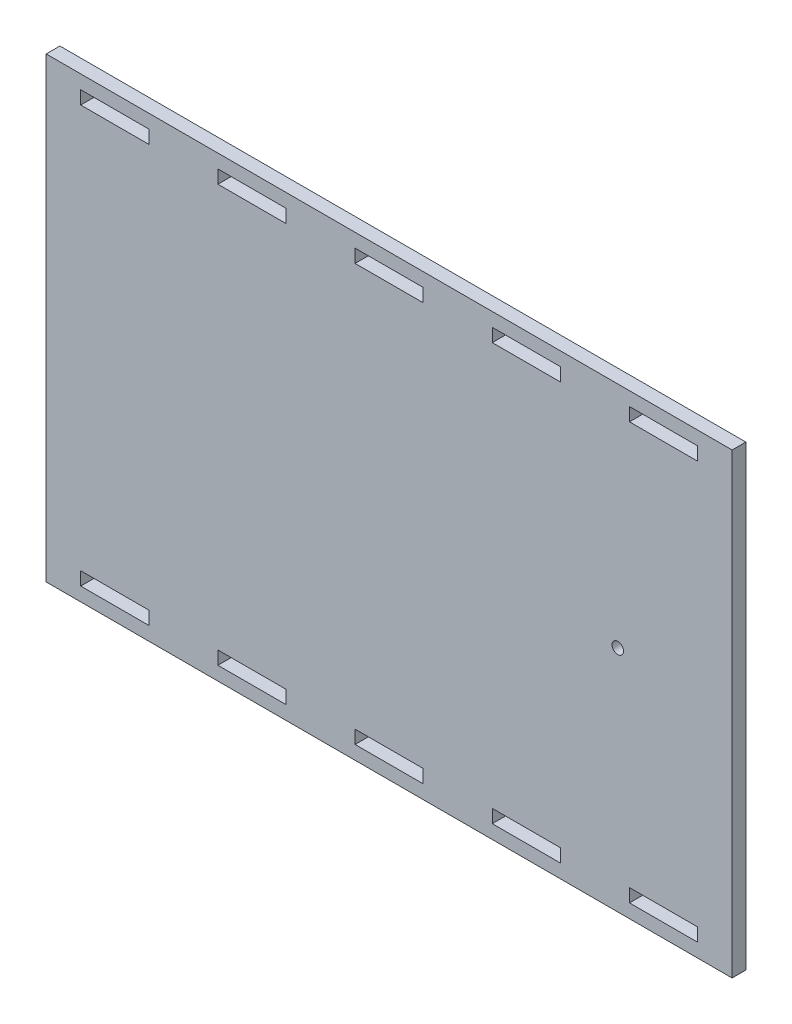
ISO-10303-21;
HEADER;
FILE_DESCRIPTION(('STEP AP214'),'2;1');
FILE_NAME('part.step','',(''),(''),'','','');
FILE_SCHEMA(('AUTOMOTIVE_DESIGN { 1 0 10303 214 1 1 1 1 }'));
ENDSEC;
DATA;
#1=APPLICATION_CONTEXT('core data for automotive mechanical design processes');
#2=APPLICATION_PROTOCOL_DEFINITION('international standard','automotive_design',2000,#1);
#3=PRODUCT_CONTEXT('',#1,'mechanical');
#4=PRODUCT('Part','Part','',(#3));
#5=PRODUCT_RELATED_PRODUCT_CATEGORY('part','',(#4));
#6=PRODUCT_DEFINITION_FORMATION('','',#4);
#7=PRODUCT_DEFINITION_CONTEXT('part definition',#1,'design');
#8=PRODUCT_DEFINITION('design','',#6,#7);
#9=PRODUCT_DEFINITION_SHAPE('','',#8);
#10=(LENGTH_UNIT() NAMED_UNIT(*) SI_UNIT(.MILLI.,.METRE.));
#11=(NAMED_UNIT(*) PLANE_ANGLE_UNIT() SI_UNIT($,.RADIAN.));
#12=(NAMED_UNIT(*) SI_UNIT($,.STERADIAN.) SOLID_ANGLE_UNIT());
#13=UNCERTAINTY_MEASURE_WITH_UNIT(LENGTH_MEASURE(1.E-05),#10,'distance_accuracy_value','');
#14=(GEOMETRIC_REPRESENTATION_CONTEXT(3) GLOBAL_UNCERTAINTY_ASSIGNED_CONTEXT((#13)) GLOBAL_UNIT_ASSIGNED_CONTEXT((#10,
#11,#12)) REPRESENTATION_CONTEXT('',''));
#15=CARTESIAN_POINT('',(0.,0.,0.));
#16=DIRECTION('',(0.,0.,1.));
#17=DIRECTION('',(1.,0.,0.));
#18=AXIS2_PLACEMENT_3D('',#15,#16,#17);
#19=CARTESIAN_POINT('',(150.,-100.,6.));
#20=DIRECTION('',(-1.,0.,0.));
#21=DIRECTION('',(0.,0.,1.));
#22=AXIS2_PLACEMENT_3D('',#19,#20,#21);
#23=PLANE('',#22);
#24=DIRECTION('',(0.,1.,0.));
#25=VECTOR('',#24,1.);
#26=CARTESIAN_POINT('',(150.,-100.,0.));
#27=LINE('',#26,#25);
#28=CARTESIAN_POINT('',(150.,-100.,0.));
#29=VERTEX_POINT('',#28);
#30=CARTESIAN_POINT('',(150.,100.,0.));
#31=VERTEX_POINT('',#30);
#32=EDGE_CURVE('E642',#29,#31,#27,.T.);
#33=ORIENTED_EDGE('',*,*,#32,.T.);
#34=DIRECTION('',(0.,0.,-1.));
#35=VECTOR('',#34,1.);
#36=CARTESIAN_POINT('',(150.,100.,6.));
#37=LINE('',#36,#35);
#38=CARTESIAN_POINT('',(150.,100.,6.));
#39=VERTEX_POINT('',#38);
#40=EDGE_CURVE('E11',#39,#31,#37,.T.);
#41=ORIENTED_EDGE('',*,*,#40,.F.);
#42=DIRECTION('',(0.,1.,0.));
#43=VECTOR('',#42,1.);
#44=CARTESIAN_POINT('',(150.,-100.,6.));
#45=LINE('',#44,#43);
#46=CARTESIAN_POINT('',(150.,-100.,6.));
#47=VERTEX_POINT('',#46);
#48=EDGE_CURVE('E643',#47,#39,#45,.T.);
#49=ORIENTED_EDGE('',*,*,#48,.F.);
#50=DIRECTION('',(0.,0.,-1.));
#51=VECTOR('',#50,1.);
#52=CARTESIAN_POINT('',(150.,-100.,6.));
#53=LINE('',#52,#51);
#54=EDGE_CURVE('E653',#47,#29,#53,.T.);
#55=ORIENTED_EDGE('',*,*,#54,.T.);
#56=EDGE_LOOP('',(#33,#41,#49,#55));
#57=FACE_BOUND('',#56,.T.);
#58=ADVANCED_FACE('F33',(#57),#23,.F.);
#59=CARTESIAN_POINT('',(-150.,100.,6.));
#60=DIRECTION('',(0.,-1.,0.));
#61=DIRECTION('',(0.,0.,-1.));
#62=AXIS2_PLACEMENT_3D('',#59,#60,#61);
#63=PLANE('',#62);
#64=DIRECTION('',(-1.,0.,0.));
#65=VECTOR('',#64,1.);
#66=CARTESIAN_POINT('',(-150.,100.,0.));
#67=LINE('',#66,#65);
#68=CARTESIAN_POINT('',(-150.,100.,0.));
#69=VERTEX_POINT('',#68);
#70=EDGE_CURVE('E656',#31,#69,#67,.T.);
#71=ORIENTED_EDGE('',*,*,#70,.T.);
#72=DIRECTION('',(0.,0.,-1.));
#73=VECTOR('',#72,1.);
#74=CARTESIAN_POINT('',(-150.,100.,6.));
#75=LINE('',#74,#73);
#76=CARTESIAN_POINT('',(-150.,100.,6.));
#77=VERTEX_POINT('',#76);
#78=EDGE_CURVE('E40',#77,#69,#75,.T.);
#79=ORIENTED_EDGE('',*,*,#78,.F.);
#80=DIRECTION('',(-1.,0.,0.));
#81=VECTOR('',#80,1.);
#82=CARTESIAN_POINT('',(-150.,100.,6.));
#83=LINE('',#82,#81);
#84=EDGE_CURVE('E646',#39,#77,#83,.T.);
#85=ORIENTED_EDGE('',*,*,#84,.F.);
#86=ORIENTED_EDGE('',*,*,#40,.T.);
#87=EDGE_LOOP('',(#71,#79,#85,#86));
#88=FACE_BOUND('',#87,.T.);
#89=ADVANCED_FACE('F685',(#88),#63,.F.);
#90=CARTESIAN_POINT('',(-150.,-100.,6.));
#91=DIRECTION('',(1.,0.,0.));
#92=DIRECTION('',(0.,0.,-1.));
#93=AXIS2_PLACEMENT_3D('',#90,#91,#92);
#94=PLANE('',#93);
#95=DIRECTION('',(0.,-1.,0.));
#96=VECTOR('',#95,1.);
#97=CARTESIAN_POINT('',(-150.,-100.,0.));
#98=LINE('',#97,#96);
#99=CARTESIAN_POINT('',(-150.,-100.,0.));
#100=VERTEX_POINT('',#99);
#101=EDGE_CURVE('E658',#69,#100,#98,.T.);
#102=ORIENTED_EDGE('',*,*,#101,.T.);
#103=DIRECTION('',(0.,0.,-1.));
#104=VECTOR('',#103,1.);
#105=CARTESIAN_POINT('',(-150.,-100.,6.));
#106=LINE('',#105,#104);
#107=CARTESIAN_POINT('',(-150.,-100.,6.));
#108=VERTEX_POINT('',#107);
#109=EDGE_CURVE('E663',#108,#100,#106,.T.);
#110=ORIENTED_EDGE('',*,*,#109,.F.);
#111=DIRECTION('',(0.,-1.,0.));
#112=VECTOR('',#111,1.);
#113=CARTESIAN_POINT('',(-150.,-100.,6.));
#114=LINE('',#113,#112);
#115=EDGE_CURVE('E649',#77,#108,#114,.T.);
#116=ORIENTED_EDGE('',*,*,#115,.F.);
#117=ORIENTED_EDGE('',*,*,#78,.T.);
#118=EDGE_LOOP('',(#102,#110,#116,#117));
#119=FACE_BOUND('',#118,.T.);
#120=ADVANCED_FACE('F670',(#119),#94,.F.);
#121=CARTESIAN_POINT('',(-150.,-100.,6.));
#122=DIRECTION('',(0.,1.,0.));
#123=DIRECTION('',(0.,0.,1.));
#124=AXIS2_PLACEMENT_3D('',#121,#122,#123);
#125=PLANE('',#124);
#126=DIRECTION('',(1.,0.,0.));
#127=VECTOR('',#126,1.);
#128=CARTESIAN_POINT('',(-150.,-100.,0.));
#129=LINE('',#128,#127);
#130=EDGE_CURVE('E647',#100,#29,#129,.T.);
#131=ORIENTED_EDGE('',*,*,#130,.T.);
#132=ORIENTED_EDGE('',*,*,#54,.F.);
#133=DIRECTION('',(1.,0.,0.));
#134=VECTOR('',#133,1.);
#135=CARTESIAN_POINT('',(-150.,-100.,6.));
#136=LINE('',#135,#134);
#137=EDGE_CURVE('E651',#108,#47,#136,.T.);
#138=ORIENTED_EDGE('',*,*,#137,.F.);
#139=ORIENTED_EDGE('',*,*,#109,.T.);
#140=EDGE_LOOP('',(#131,#132,#138,#139));
#141=FACE_BOUND('',#140,.T.);
#142=ADVANCED_FACE('F678',(#141),#125,.F.);
#143=CARTESIAN_POINT('',(0.,0.,6.));
#144=DIRECTION('',(0.,0.,-1.));
#145=DIRECTION('',(-1.,0.,0.));
#146=AXIS2_PLACEMENT_3D('',#143,#144,#145);
#147=PLANE('',#146);
#148=CARTESIAN_POINT('',(100.,0.,6.));
#149=DIRECTION('',(0.,0.,1.));
#150=DIRECTION('',(1.,0.,0.));
#151=AXIS2_PLACEMENT_3D('',#148,#149,#150);
#152=CIRCLE('',#151,2.49999999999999);
#153=CARTESIAN_POINT('',(102.5,0.,6.));
#154=VERTEX_POINT('',#153);
#155=EDGE_CURVE('E457',#154,#154,#152,.T.);
#156=ORIENTED_EDGE('',*,*,#155,.F.);
#157=EDGE_LOOP('',(#156));
#158=FACE_BOUND('',#157,.T.);
#159=DIRECTION('',(0.,1.,0.));
#160=VECTOR('',#159,1.);
#161=CARTESIAN_POINT('',(-105.1,88.2,6.));
#162=LINE('',#161,#160);
#163=CARTESIAN_POINT('',(-105.1,88.2,6.));
#164=VERTEX_POINT('',#163);
#165=CARTESIAN_POINT('',(-105.1,94.,6.));
#166=VERTEX_POINT('',#165);
#167=EDGE_CURVE('E464',#164,#166,#162,.T.);
#168=ORIENTED_EDGE('',*,*,#167,.F.);
#169=DIRECTION('',(1.,0.,0.));
#170=VECTOR('',#169,1.);
#171=CARTESIAN_POINT('',(-134.9,88.2,6.));
#172=LINE('',#171,#170);
#173=CARTESIAN_POINT('',(-134.9,88.2,6.));
#174=VERTEX_POINT('',#173);
#175=EDGE_CURVE('E47',#174,#164,#172,.T.);
#176=ORIENTED_EDGE('',*,*,#175,.F.);
#177=DIRECTION('',(0.,-1.,0.));
#178=VECTOR('',#177,1.);
#179=CARTESIAN_POINT('',(-134.9,88.2,6.));
#180=LINE('',#179,#178);
#181=CARTESIAN_POINT('',(-134.9,94.,6.));
#182=VERTEX_POINT('',#181);
#183=EDGE_CURVE('E470',#182,#174,#180,.T.);
#184=ORIENTED_EDGE('',*,*,#183,.F.);
#185=DIRECTION('',(-1.,0.,0.));
#186=VECTOR('',#185,1.);
#187=CARTESIAN_POINT('',(-134.9,94.,6.));
#188=LINE('',#187,#186);
#189=EDGE_CURVE('E467',#166,#182,#188,.T.);
#190=ORIENTED_EDGE('',*,*,#189,.F.);
#191=EDGE_LOOP('',(#168,#176,#184,#190));
#192=FACE_BOUND('',#191,.T.);
#193=DIRECTION('',(0.,1.,0.));
#194=VECTOR('',#193,1.);
#195=CARTESIAN_POINT('',(-45.1,88.2,6.));
#196=LINE('',#195,#194);
#197=CARTESIAN_POINT('',(-45.1,88.2,6.));
#198=VERTEX_POINT('',#197);
#199=CARTESIAN_POINT('',(-45.1,94.,6.));
#200=VERTEX_POINT('',#199);
#201=EDGE_CURVE('E434',#198,#200,#196,.T.);
#202=ORIENTED_EDGE('',*,*,#201,.F.);
#203=DIRECTION('',(1.,0.,0.));
#204=VECTOR('',#203,1.);
#205=CARTESIAN_POINT('',(-74.8999999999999,88.2,6.));
#206=LINE('',#205,#204);
#207=CARTESIAN_POINT('',(-74.8999999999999,88.2,6.));
#208=VERTEX_POINT('',#207);
#209=EDGE_CURVE('E55',#208,#198,#206,.T.);
#210=ORIENTED_EDGE('',*,*,#209,.F.);
#211=DIRECTION('',(0.,-1.,0.));
#212=VECTOR('',#211,1.);
#213=CARTESIAN_POINT('',(-74.8999999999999,88.2,6.));
#214=LINE('',#213,#212);
#215=CARTESIAN_POINT('',(-74.9,94.,6.));
#216=VERTEX_POINT('',#215);
#217=EDGE_CURVE('E440',#216,#208,#214,.T.);
#218=ORIENTED_EDGE('',*,*,#217,.F.);
#219=DIRECTION('',(-1.,0.,0.));
#220=VECTOR('',#219,1.);
#221=CARTESIAN_POINT('',(-74.9,94.,6.));
#222=LINE('',#221,#220);
#223=EDGE_CURVE('E437',#200,#216,#222,.T.);
#224=ORIENTED_EDGE('',*,*,#223,.F.);
#225=EDGE_LOOP('',(#202,#210,#218,#224));
#226=FACE_BOUND('',#225,.T.);
#227=DIRECTION('',(0.,1.,0.));
#228=VECTOR('',#227,1.);
#229=CARTESIAN_POINT('',(14.9,88.2,6.));
#230=LINE('',#229,#228);
#231=CARTESIAN_POINT('',(14.9,88.2,6.));
#232=VERTEX_POINT('',#231);
#233=CARTESIAN_POINT('',(14.9,94.,6.));
#234=VERTEX_POINT('',#233);
#235=EDGE_CURVE('E403',#232,#234,#230,.T.);
#236=ORIENTED_EDGE('',*,*,#235,.F.);
#237=DIRECTION('',(1.,0.,0.));
#238=VECTOR('',#237,1.);
#239=CARTESIAN_POINT('',(-14.8999999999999,88.2,6.));
#240=LINE('',#239,#238);
#241=CARTESIAN_POINT('',(-14.8999999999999,88.2,6.));
#242=VERTEX_POINT('',#241);
#243=EDGE_CURVE('E401',#242,#232,#240,.T.);
#244=ORIENTED_EDGE('',*,*,#243,.F.);
#245=DIRECTION('',(0.,-1.,0.));
#246=VECTOR('',#245,1.);
#247=CARTESIAN_POINT('',(-14.8999999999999,88.2,6.));
#248=LINE('',#247,#246);
#249=CARTESIAN_POINT('',(-14.9,94.,6.));
#250=VERTEX_POINT('',#249);
#251=EDGE_CURVE('E409',#250,#242,#248,.T.);
#252=ORIENTED_EDGE('',*,*,#251,.F.);
#253=DIRECTION('',(-1.,0.,0.));
#254=VECTOR('',#253,1.);
#255=CARTESIAN_POINT('',(-14.9,94.,6.));
#256=LINE('',#255,#254);
#257=EDGE_CURVE('E406',#234,#250,#256,.T.);
#258=ORIENTED_EDGE('',*,*,#257,.F.);
#259=EDGE_LOOP('',(#236,#244,#252,#258));
#260=FACE_BOUND('',#259,.T.);
#261=DIRECTION('',(0.,1.,0.));
#262=VECTOR('',#261,1.);
#263=CARTESIAN_POINT('',(74.9,88.2,6.));
#264=LINE('',#263,#262);
#265=CARTESIAN_POINT('',(74.9,88.2,6.));
#266=VERTEX_POINT('',#265);
#267=CARTESIAN_POINT('',(74.9,94.,6.));
#268=VERTEX_POINT('',#267);
#269=EDGE_CURVE('E370',#266,#268,#264,.T.);
#270=ORIENTED_EDGE('',*,*,#269,.F.);
#271=DIRECTION('',(1.,0.,0.));
#272=VECTOR('',#271,1.);
#273=CARTESIAN_POINT('',(45.1000000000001,88.2,6.));
#274=LINE('',#273,#272);
#275=CARTESIAN_POINT('',(45.1000000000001,88.2,6.));
#276=VERTEX_POINT('',#275);
#277=EDGE_CURVE('E368',#276,#266,#274,.T.);
#278=ORIENTED_EDGE('',*,*,#277,.F.);
#279=DIRECTION('',(0.,-1.,0.));
#280=VECTOR('',#279,1.);
#281=CARTESIAN_POINT('',(45.1000000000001,88.2,6.));
#282=LINE('',#281,#280);
#283=CARTESIAN_POINT('',(45.1,94.,6.));
#284=VERTEX_POINT('',#283);
#285=EDGE_CURVE('E376',#284,#276,#282,.T.);
#286=ORIENTED_EDGE('',*,*,#285,.F.);
#287=DIRECTION('',(-1.,0.,0.));
#288=VECTOR('',#287,1.);
#289=CARTESIAN_POINT('',(45.1,94.,6.));
#290=LINE('',#289,#288);
#291=EDGE_CURVE('E373',#268,#284,#290,.T.);
#292=ORIENTED_EDGE('',*,*,#291,.F.);
#293=EDGE_LOOP('',(#270,#278,#286,#292));
#294=FACE_BOUND('',#293,.T.);
#295=DIRECTION('',(1.,0.,0.));
#296=VECTOR('',#295,1.);
#297=CARTESIAN_POINT('',(105.1,-94.,6.));
#298=LINE('',#297,#296);
#299=CARTESIAN_POINT('',(105.1,-94.,6.));
#300=VERTEX_POINT('',#299);
#301=CARTESIAN_POINT('',(134.9,-94.,6.));
#302=VERTEX_POINT('',#301);
#303=EDGE_CURVE('E342',#300,#302,#298,.T.);
#304=ORIENTED_EDGE('',*,*,#303,.F.);
#305=DIRECTION('',(0.,-1.,0.));
#306=VECTOR('',#305,1.);
#307=CARTESIAN_POINT('',(105.1,-88.2,6.));
#308=LINE('',#307,#306);
#309=CARTESIAN_POINT('',(105.1,-88.2,6.));
#310=VERTEX_POINT('',#309);
#311=EDGE_CURVE('E334',#310,#300,#308,.T.);
#312=ORIENTED_EDGE('',*,*,#311,.F.);
#313=DIRECTION('',(-1.,0.,0.));
#314=VECTOR('',#313,1.);
#315=CARTESIAN_POINT('',(105.1,-88.2,6.));
#316=LINE('',#315,#314);
#317=CARTESIAN_POINT('',(134.9,-88.2,6.));
#318=VERTEX_POINT('',#317);
#319=EDGE_CURVE('E335',#318,#310,#316,.T.);
#320=ORIENTED_EDGE('',*,*,#319,.F.);
#321=DIRECTION('',(0.,1.,0.));
#322=VECTOR('',#321,1.);
#323=CARTESIAN_POINT('',(134.9,-88.2,6.));
#324=LINE('',#323,#322);
#325=EDGE_CURVE('E349',#302,#318,#324,.T.);
#326=ORIENTED_EDGE('',*,*,#325,.F.);
#327=EDGE_LOOP('',(#304,#312,#320,#326));
#328=FACE_BOUND('',#327,.T.);
#329=DIRECTION('',(0.,1.,0.));
#330=VECTOR('',#329,1.);
#331=CARTESIAN_POINT('',(134.9,88.2,6.));
#332=LINE('',#331,#330);
#333=CARTESIAN_POINT('',(134.9,88.2,6.));
#334=VERTEX_POINT('',#333);
#335=CARTESIAN_POINT('',(134.9,94.,6.));
#336=VERTEX_POINT('',#335);
#337=EDGE_CURVE('E559',#334,#336,#332,.T.);
#338=ORIENTED_EDGE('',*,*,#337,.F.);
#339=DIRECTION('',(1.,0.,0.));
#340=VECTOR('',#339,1.);
#341=CARTESIAN_POINT('',(105.1,88.2,6.));
#342=LINE('',#341,#340);
#343=CARTESIAN_POINT('',(105.1,88.2,6.));
#344=VERTEX_POINT('',#343);
#345=EDGE_CURVE('E557',#344,#334,#342,.T.);
#346=ORIENTED_EDGE('',*,*,#345,.F.);
#347=DIRECTION('',(0.,-1.,0.));
#348=VECTOR('',#347,1.);
#349=CARTESIAN_POINT('',(105.1,88.2,6.));
#350=LINE('',#349,#348);
#351=CARTESIAN_POINT('',(105.1,94.,6.));
#352=VERTEX_POINT('',#351);
#353=EDGE_CURVE('E565',#352,#344,#350,.T.);
#354=ORIENTED_EDGE('',*,*,#353,.F.);
#355=DIRECTION('',(-1.,0.,0.));
#356=VECTOR('',#355,1.);
#357=CARTESIAN_POINT('',(105.1,94.,6.));
#358=LINE('',#357,#356);
#359=EDGE_CURVE('E562',#336,#352,#358,.T.);
#360=ORIENTED_EDGE('',*,*,#359,.F.);
#361=EDGE_LOOP('',(#338,#346,#354,#360));
#362=FACE_BOUND('',#361,.T.);
#363=DIRECTION('',(1.,0.,0.));
#364=VECTOR('',#363,1.);
#365=CARTESIAN_POINT('',(-74.9,-94.,6.));
#366=LINE('',#365,#364);
#367=CARTESIAN_POINT('',(-74.9,-94.,6.));
#368=VERTEX_POINT('',#367);
#369=CARTESIAN_POINT('',(-45.1,-94.,6.));
#370=VERTEX_POINT('',#369);
#371=EDGE_CURVE('E591',#368,#370,#366,.T.);
#372=ORIENTED_EDGE('',*,*,#371,.F.);
#373=DIRECTION('',(0.,-1.,0.));
#374=VECTOR('',#373,1.);
#375=CARTESIAN_POINT('',(-74.8999999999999,-88.2,6.));
#376=LINE('',#375,#374);
#377=CARTESIAN_POINT('',(-74.8999999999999,-88.2,6.));
#378=VERTEX_POINT('',#377);
#379=EDGE_CURVE('E589',#378,#368,#376,.T.);
#380=ORIENTED_EDGE('',*,*,#379,.F.);
#381=DIRECTION('',(-1.,0.,0.));
#382=VECTOR('',#381,1.);
#383=CARTESIAN_POINT('',(-74.8999999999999,-88.2,6.));
#384=LINE('',#383,#382);
#385=CARTESIAN_POINT('',(-45.1,-88.2,6.));
#386=VERTEX_POINT('',#385);
#387=EDGE_CURVE('E597',#386,#378,#384,.T.);
#388=ORIENTED_EDGE('',*,*,#387,.F.);
#389=DIRECTION('',(0.,1.,0.));
#390=VECTOR('',#389,1.);
#391=CARTESIAN_POINT('',(-45.1,-88.2,6.));
#392=LINE('',#391,#390);
#393=EDGE_CURVE('E594',#370,#386,#392,.T.);
#394=ORIENTED_EDGE('',*,*,#393,.F.);
#395=EDGE_LOOP('',(#372,#380,#388,#394));
#396=FACE_BOUND('',#395,.T.);
#397=DIRECTION('',(1.,0.,0.));
#398=VECTOR('',#397,1.);
#399=CARTESIAN_POINT('',(-14.9,-94.,6.));
#400=LINE('',#399,#398);
#401=CARTESIAN_POINT('',(-14.9,-94.,6.));
#402=VERTEX_POINT('',#401);
#403=CARTESIAN_POINT('',(14.9,-94.,6.));
#404=VERTEX_POINT('',#403);
#405=EDGE_CURVE('E495',#402,#404,#400,.T.);
#406=ORIENTED_EDGE('',*,*,#405,.F.);
#407=DIRECTION('',(0.,-1.,0.));
#408=VECTOR('',#407,1.);
#409=CARTESIAN_POINT('',(-14.8999999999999,-88.2,6.));
#410=LINE('',#409,#408);
#411=CARTESIAN_POINT('',(-14.8999999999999,-88.2,6.));
#412=VERTEX_POINT('',#411);
#413=EDGE_CURVE('E493',#412,#402,#410,.T.);
#414=ORIENTED_EDGE('',*,*,#413,.F.);
#415=DIRECTION('',(-1.,0.,0.));
#416=VECTOR('',#415,1.);
#417=CARTESIAN_POINT('',(-14.8999999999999,-88.2,6.));
#418=LINE('',#417,#416);
#419=CARTESIAN_POINT('',(14.9,-88.2,6.));
#420=VERTEX_POINT('',#419);
#421=EDGE_CURVE('E501',#420,#412,#418,.T.);
#422=ORIENTED_EDGE('',*,*,#421,.F.);
#423=DIRECTION('',(0.,1.,0.));
#424=VECTOR('',#423,1.);
#425=CARTESIAN_POINT('',(14.9,-88.2,6.));
#426=LINE('',#425,#424);
#427=EDGE_CURVE('E498',#404,#420,#426,.T.);
#428=ORIENTED_EDGE('',*,*,#427,.F.);
#429=EDGE_LOOP('',(#406,#414,#422,#428));
#430=FACE_BOUND('',#429,.T.);
#431=DIRECTION('',(1.,0.,0.));
#432=VECTOR('',#431,1.);
#433=CARTESIAN_POINT('',(45.1,-94.,6.));
#434=LINE('',#433,#432);
#435=CARTESIAN_POINT('',(45.1,-94.,6.));
#436=VERTEX_POINT('',#435);
#437=CARTESIAN_POINT('',(74.9,-94.,6.));
#438=VERTEX_POINT('',#437);
#439=EDGE_CURVE('E527',#436,#438,#434,.T.);
#440=ORIENTED_EDGE('',*,*,#439,.F.);
#441=DIRECTION('',(0.,-1.,0.));
#442=VECTOR('',#441,1.);
#443=CARTESIAN_POINT('',(45.1000000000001,-88.2,6.));
#444=LINE('',#443,#442);
#445=CARTESIAN_POINT('',(45.1000000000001,-88.2,6.));
#446=VERTEX_POINT('',#445);
#447=EDGE_CURVE('E525',#446,#436,#444,.T.);
#448=ORIENTED_EDGE('',*,*,#447,.F.);
#449=DIRECTION('',(-1.,0.,0.));
#450=VECTOR('',#449,1.);
#451=CARTESIAN_POINT('',(45.1000000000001,-88.2,6.));
#452=LINE('',#451,#450);
#453=CARTESIAN_POINT('',(74.9,-88.2,6.));
#454=VERTEX_POINT('',#453);
#455=EDGE_CURVE('E533',#454,#446,#452,.T.);
#456=ORIENTED_EDGE('',*,*,#455,.F.);
#457=DIRECTION('',(0.,1.,0.));
#458=VECTOR('',#457,1.);
#459=CARTESIAN_POINT('',(74.9,-88.2,6.));
#460=LINE('',#459,#458);
#461=EDGE_CURVE('E530',#438,#454,#460,.T.);
#462=ORIENTED_EDGE('',*,*,#461,.F.);
#463=EDGE_LOOP('',(#440,#448,#456,#462));
#464=FACE_BOUND('',#463,.T.);
#465=DIRECTION('',(1.,0.,0.));
#466=VECTOR('',#465,1.);
#467=CARTESIAN_POINT('',(-134.9,-94.,6.));
#468=LINE('',#467,#466);
#469=CARTESIAN_POINT('',(-134.9,-94.,6.));
#470=VERTEX_POINT('',#469);
#471=CARTESIAN_POINT('',(-105.1,-94.,6.));
#472=VERTEX_POINT('',#471);
#473=EDGE_CURVE('E621',#470,#472,#468,.T.);
#474=ORIENTED_EDGE('',*,*,#473,.F.);
#475=DIRECTION('',(0.,-1.,0.));
#476=VECTOR('',#475,1.);
#477=CARTESIAN_POINT('',(-134.9,-88.2,6.));
#478=LINE('',#477,#476);
#479=CARTESIAN_POINT('',(-134.9,-88.2,6.));
#480=VERTEX_POINT('',#479);
#481=EDGE_CURVE('E619',#480,#470,#478,.T.);
#482=ORIENTED_EDGE('',*,*,#481,.F.);
#483=DIRECTION('',(-1.,0.,0.));
#484=VECTOR('',#483,1.);
#485=CARTESIAN_POINT('',(-134.9,-88.2,6.));
#486=LINE('',#485,#484);
#487=CARTESIAN_POINT('',(-105.1,-88.2,6.));
#488=VERTEX_POINT('',#487);
#489=EDGE_CURVE('E627',#488,#480,#486,.T.);
#490=ORIENTED_EDGE('',*,*,#489,.F.);
#491=DIRECTION('',(0.,1.,0.));
#492=VECTOR('',#491,1.);
#493=CARTESIAN_POINT('',(-105.1,-88.2,6.));
#494=LINE('',#493,#492);
#495=EDGE_CURVE('E624',#472,#488,#494,.T.);
#496=ORIENTED_EDGE('',*,*,#495,.F.);
#497=EDGE_LOOP('',(#474,#482,#490,#496));
#498=FACE_BOUND('',#497,.T.);
#499=ORIENTED_EDGE('',*,*,#48,.T.);
#500=ORIENTED_EDGE('',*,*,#84,.T.);
#501=ORIENTED_EDGE('',*,*,#115,.T.);
#502=ORIENTED_EDGE('',*,*,#137,.T.);
#503=EDGE_LOOP('',(#499,#500,#501,#502));
#504=FACE_BOUND('',#503,.T.);
#505=ADVANCED_FACE('F684',(#158,#192,#226,#260,#294,#328,#362,#396,#430,#464,#498,#504),#147,.F.);
#506=CARTESIAN_POINT('',(0.,0.,0.));
#507=DIRECTION('',(0.,0.,-1.));
#508=DIRECTION('',(-1.,0.,0.));
#509=AXIS2_PLACEMENT_3D('',#506,#507,#508);
#510=PLANE('',#509);
#511=CARTESIAN_POINT('',(100.,0.,0.));
#512=DIRECTION('',(0.,0.,-1.));
#513=DIRECTION('',(-1.,0.,0.));
#514=AXIS2_PLACEMENT_3D('',#511,#512,#513);
#515=CIRCLE('',#514,2.49999999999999);
#516=CARTESIAN_POINT('',(102.5,0.,0.));
#517=VERTEX_POINT('',#516);
#518=EDGE_CURVE('E863',#517,#517,#515,.F.);
#519=ORIENTED_EDGE('',*,*,#518,.T.);
#520=EDGE_LOOP('',(#519));
#521=FACE_BOUND('',#520,.T.);
#522=DIRECTION('',(1.,0.,0.));
#523=VECTOR('',#522,1.);
#524=CARTESIAN_POINT('',(-134.9,88.2,0.));
#525=LINE('',#524,#523);
#526=CARTESIAN_POINT('',(-134.9,88.2,0.));
#527=VERTEX_POINT('',#526);
#528=CARTESIAN_POINT('',(-105.1,88.2,0.));
#529=VERTEX_POINT('',#528);
#530=EDGE_CURVE('E460',#527,#529,#525,.T.);
#531=ORIENTED_EDGE('',*,*,#530,.T.);
#532=DIRECTION('',(0.,1.,0.));
#533=VECTOR('',#532,1.);
#534=CARTESIAN_POINT('',(-105.1,88.2,0.));
#535=LINE('',#534,#533);
#536=CARTESIAN_POINT('',(-105.1,94.,0.));
#537=VERTEX_POINT('',#536);
#538=EDGE_CURVE('E427',#529,#537,#535,.T.);
#539=ORIENTED_EDGE('',*,*,#538,.T.);
#540=DIRECTION('',(-1.,0.,0.));
#541=VECTOR('',#540,1.);
#542=CARTESIAN_POINT('',(-134.9,94.,0.));
#543=LINE('',#542,#541);
#544=CARTESIAN_POINT('',(-134.9,94.,0.));
#545=VERTEX_POINT('',#544);
#546=EDGE_CURVE('E453',#537,#545,#543,.T.);
#547=ORIENTED_EDGE('',*,*,#546,.T.);
#548=DIRECTION('',(0.,-1.,0.));
#549=VECTOR('',#548,1.);
#550=CARTESIAN_POINT('',(-134.9,88.2,0.));
#551=LINE('',#550,#549);
#552=EDGE_CURVE('E456',#545,#527,#551,.T.);
#553=ORIENTED_EDGE('',*,*,#552,.T.);
#554=EDGE_LOOP('',(#531,#539,#547,#553));
#555=FACE_BOUND('',#554,.T.);
#556=DIRECTION('',(1.,0.,0.));
#557=VECTOR('',#556,1.);
#558=CARTESIAN_POINT('',(-74.8999999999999,88.2,0.));
#559=LINE('',#558,#557);
#560=CARTESIAN_POINT('',(-74.8999999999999,88.2,0.));
#561=VERTEX_POINT('',#560);
#562=CARTESIAN_POINT('',(-45.1,88.2,0.));
#563=VERTEX_POINT('',#562);
#564=EDGE_CURVE('E430',#561,#563,#559,.T.);
#565=ORIENTED_EDGE('',*,*,#564,.T.);
#566=DIRECTION('',(0.,1.,0.));
#567=VECTOR('',#566,1.);
#568=CARTESIAN_POINT('',(-45.1,88.2,0.));
#569=LINE('',#568,#567);
#570=CARTESIAN_POINT('',(-45.1,94.,0.));
#571=VERTEX_POINT('',#570);
#572=EDGE_CURVE('E395',#563,#571,#569,.T.);
#573=ORIENTED_EDGE('',*,*,#572,.T.);
#574=DIRECTION('',(-1.,0.,0.));
#575=VECTOR('',#574,1.);
#576=CARTESIAN_POINT('',(-74.9,94.,0.));
#577=LINE('',#576,#575);
#578=CARTESIAN_POINT('',(-74.9,94.,0.));
#579=VERTEX_POINT('',#578);
#580=EDGE_CURVE('E423',#571,#579,#577,.T.);
#581=ORIENTED_EDGE('',*,*,#580,.T.);
#582=DIRECTION('',(0.,-1.,0.));
#583=VECTOR('',#582,1.);
#584=CARTESIAN_POINT('',(-74.8999999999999,88.2,0.));
#585=LINE('',#584,#583);
#586=EDGE_CURVE('E426',#579,#561,#585,.T.);
#587=ORIENTED_EDGE('',*,*,#586,.T.);
#588=EDGE_LOOP('',(#565,#573,#581,#587));
#589=FACE_BOUND('',#588,.T.);
#590=DIRECTION('',(1.,0.,0.));
#591=VECTOR('',#590,1.);
#592=CARTESIAN_POINT('',(-14.8999999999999,88.2,0.));
#593=LINE('',#592,#591);
#594=CARTESIAN_POINT('',(-14.8999999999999,88.2,0.));
#595=VERTEX_POINT('',#594);
#596=CARTESIAN_POINT('',(14.9,88.2,0.));
#597=VERTEX_POINT('',#596);
#598=EDGE_CURVE('E398',#595,#597,#593,.T.);
#599=ORIENTED_EDGE('',*,*,#598,.T.);
#600=DIRECTION('',(0.,1.,0.));
#601=VECTOR('',#600,1.);
#602=CARTESIAN_POINT('',(14.9,88.2,0.));
#603=LINE('',#602,#601);
#604=CARTESIAN_POINT('',(14.9,94.,0.));
#605=VERTEX_POINT('',#604);
#606=EDGE_CURVE('E362',#597,#605,#603,.T.);
#607=ORIENTED_EDGE('',*,*,#606,.T.);
#608=DIRECTION('',(-1.,0.,0.));
#609=VECTOR('',#608,1.);
#610=CARTESIAN_POINT('',(-14.9,94.,0.));
#611=LINE('',#610,#609);
#612=CARTESIAN_POINT('',(-14.9,94.,0.));
#613=VERTEX_POINT('',#612);
#614=EDGE_CURVE('E391',#605,#613,#611,.T.);
#615=ORIENTED_EDGE('',*,*,#614,.T.);
#616=DIRECTION('',(0.,-1.,0.));
#617=VECTOR('',#616,1.);
#618=CARTESIAN_POINT('',(-14.8999999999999,88.2,0.));
#619=LINE('',#618,#617);
#620=EDGE_CURVE('E394',#613,#595,#619,.T.);
#621=ORIENTED_EDGE('',*,*,#620,.T.);
#622=EDGE_LOOP('',(#599,#607,#615,#621));
#623=FACE_BOUND('',#622,.T.);
#624=DIRECTION('',(1.,0.,0.));
#625=VECTOR('',#624,1.);
#626=CARTESIAN_POINT('',(45.1000000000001,88.2,0.));
#627=LINE('',#626,#625);
#628=CARTESIAN_POINT('',(45.1000000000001,88.2,0.));
#629=VERTEX_POINT('',#628);
#630=CARTESIAN_POINT('',(74.9,88.2,0.));
#631=VERTEX_POINT('',#630);
#632=EDGE_CURVE('E365',#629,#631,#627,.T.);
#633=ORIENTED_EDGE('',*,*,#632,.T.);
#634=DIRECTION('',(0.,1.,0.));
#635=VECTOR('',#634,1.);
#636=CARTESIAN_POINT('',(74.9,88.2,0.));
#637=LINE('',#636,#635);
#638=CARTESIAN_POINT('',(74.9,94.,0.));
#639=VERTEX_POINT('',#638);
#640=EDGE_CURVE('E382',#631,#639,#637,.T.);
#641=ORIENTED_EDGE('',*,*,#640,.T.);
#642=DIRECTION('',(-1.,0.,0.));
#643=VECTOR('',#642,1.);
#644=CARTESIAN_POINT('',(45.1,94.,0.));
#645=LINE('',#644,#643);
#646=CARTESIAN_POINT('',(45.1,94.,0.));
#647=VERTEX_POINT('',#646);
#648=EDGE_CURVE('E358',#639,#647,#645,.T.);
#649=ORIENTED_EDGE('',*,*,#648,.T.);
#650=DIRECTION('',(0.,-1.,0.));
#651=VECTOR('',#650,1.);
#652=CARTESIAN_POINT('',(45.1000000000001,88.2,0.));
#653=LINE('',#652,#651);
#654=EDGE_CURVE('E361',#647,#629,#653,.T.);
#655=ORIENTED_EDGE('',*,*,#654,.T.);
#656=EDGE_LOOP('',(#633,#641,#649,#655));
#657=FACE_BOUND('',#656,.T.);
#658=DIRECTION('',(0.,-1.,0.));
#659=VECTOR('',#658,1.);
#660=CARTESIAN_POINT('',(105.1,-88.2,0.));
#661=LINE('',#660,#659);
#662=CARTESIAN_POINT('',(105.1,-88.2,0.));
#663=VERTEX_POINT('',#662);
#664=CARTESIAN_POINT('',(105.1,-94.,0.));
#665=VERTEX_POINT('',#664);
#666=EDGE_CURVE('E331',#663,#665,#661,.T.);
#667=ORIENTED_EDGE('',*,*,#666,.T.);
#668=DIRECTION('',(1.,0.,0.));
#669=VECTOR('',#668,1.);
#670=CARTESIAN_POINT('',(105.1,-94.,0.));
#671=LINE('',#670,#669);
#672=CARTESIAN_POINT('',(134.9,-94.,0.));
#673=VERTEX_POINT('',#672);
#674=EDGE_CURVE('E315',#665,#673,#671,.T.);
#675=ORIENTED_EDGE('',*,*,#674,.T.);
#676=DIRECTION('',(0.,1.,0.));
#677=VECTOR('',#676,1.);
#678=CARTESIAN_POINT('',(134.9,-88.2,0.));
#679=LINE('',#678,#677);
#680=CARTESIAN_POINT('',(134.9,-88.2,0.));
#681=VERTEX_POINT('',#680);
#682=EDGE_CURVE('E344',#673,#681,#679,.T.);
#683=ORIENTED_EDGE('',*,*,#682,.T.);
#684=DIRECTION('',(-1.,0.,0.));
#685=VECTOR('',#684,1.);
#686=CARTESIAN_POINT('',(105.1,-88.2,0.));
#687=LINE('',#686,#685);
#688=EDGE_CURVE('E340',#681,#663,#687,.T.);
#689=ORIENTED_EDGE('',*,*,#688,.T.);
#690=EDGE_LOOP('',(#667,#675,#683,#689));
#691=FACE_BOUND('',#690,.T.);
#692=DIRECTION('',(1.,0.,0.));
#693=VECTOR('',#692,1.);
#694=CARTESIAN_POINT('',(105.1,88.2,0.));
#695=LINE('',#694,#693);
#696=CARTESIAN_POINT('',(105.1,88.2,0.));
#697=VERTEX_POINT('',#696);
#698=CARTESIAN_POINT('',(134.9,88.2,0.));
#699=VERTEX_POINT('',#698);
#700=EDGE_CURVE('E554',#697,#699,#695,.T.);
#701=ORIENTED_EDGE('',*,*,#700,.T.);
#702=DIRECTION('',(0.,1.,0.));
#703=VECTOR('',#702,1.);
#704=CARTESIAN_POINT('',(134.9,88.2,0.));
#705=LINE('',#704,#703);
#706=CARTESIAN_POINT('',(134.9,94.,0.));
#707=VERTEX_POINT('',#706);
#708=EDGE_CURVE('E571',#699,#707,#705,.T.);
#709=ORIENTED_EDGE('',*,*,#708,.T.);
#710=DIRECTION('',(-1.,0.,0.));
#711=VECTOR('',#710,1.);
#712=CARTESIAN_POINT('',(105.1,94.,0.));
#713=LINE('',#712,#711);
#714=CARTESIAN_POINT('',(105.1,94.,0.));
#715=VERTEX_POINT('',#714);
#716=EDGE_CURVE('E547',#707,#715,#713,.T.);
#717=ORIENTED_EDGE('',*,*,#716,.T.);
#718=DIRECTION('',(0.,-1.,0.));
#719=VECTOR('',#718,1.);
#720=CARTESIAN_POINT('',(105.1,88.2,0.));
#721=LINE('',#720,#719);
#722=EDGE_CURVE('E550',#715,#697,#721,.T.);
#723=ORIENTED_EDGE('',*,*,#722,.T.);
#724=EDGE_LOOP('',(#701,#709,#717,#723));
#725=FACE_BOUND('',#724,.T.);
#726=DIRECTION('',(0.,-1.,0.));
#727=VECTOR('',#726,1.);
#728=CARTESIAN_POINT('',(-74.8999999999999,-88.2,0.));
#729=LINE('',#728,#727);
#730=CARTESIAN_POINT('',(-74.8999999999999,-88.2,0.));
#731=VERTEX_POINT('',#730);
#732=CARTESIAN_POINT('',(-74.9,-94.,0.));
#733=VERTEX_POINT('',#732);
#734=EDGE_CURVE('E586',#731,#733,#729,.T.);
#735=ORIENTED_EDGE('',*,*,#734,.T.);
#736=DIRECTION('',(1.,0.,0.));
#737=VECTOR('',#736,1.);
#738=CARTESIAN_POINT('',(-74.9,-94.,0.));
#739=LINE('',#738,#737);
#740=CARTESIAN_POINT('',(-45.1,-94.,0.));
#741=VERTEX_POINT('',#740);
#742=EDGE_CURVE('E551',#733,#741,#739,.T.);
#743=ORIENTED_EDGE('',*,*,#742,.T.);
#744=DIRECTION('',(0.,1.,0.));
#745=VECTOR('',#744,1.);
#746=CARTESIAN_POINT('',(-45.1,-88.2,0.));
#747=LINE('',#746,#745);
#748=CARTESIAN_POINT('',(-45.1,-88.2,0.));
#749=VERTEX_POINT('',#748);
#750=EDGE_CURVE('E516',#741,#749,#747,.T.);
#751=ORIENTED_EDGE('',*,*,#750,.T.);
#752=DIRECTION('',(-1.,0.,0.));
#753=VECTOR('',#752,1.);
#754=CARTESIAN_POINT('',(-74.8999999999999,-88.2,0.));
#755=LINE('',#754,#753);
#756=EDGE_CURVE('E583',#749,#731,#755,.T.);
#757=ORIENTED_EDGE('',*,*,#756,.T.);
#758=EDGE_LOOP('',(#735,#743,#751,#757));
#759=FACE_BOUND('',#758,.T.);
#760=DIRECTION('',(0.,-1.,0.));
#761=VECTOR('',#760,1.);
#762=CARTESIAN_POINT('',(-14.8999999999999,-88.2,0.));
#763=LINE('',#762,#761);
#764=CARTESIAN_POINT('',(-14.8999999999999,-88.2,0.));
#765=VERTEX_POINT('',#764);
#766=CARTESIAN_POINT('',(-14.9,-94.,0.));
#767=VERTEX_POINT('',#766);
#768=EDGE_CURVE('E490',#765,#767,#763,.T.);
#769=ORIENTED_EDGE('',*,*,#768,.T.);
#770=DIRECTION('',(1.,0.,0.));
#771=VECTOR('',#770,1.);
#772=CARTESIAN_POINT('',(-14.9,-94.,0.));
#773=LINE('',#772,#771);
#774=CARTESIAN_POINT('',(14.9,-94.,0.));
#775=VERTEX_POINT('',#774);
#776=EDGE_CURVE('E507',#767,#775,#773,.T.);
#777=ORIENTED_EDGE('',*,*,#776,.T.);
#778=DIRECTION('',(0.,1.,0.));
#779=VECTOR('',#778,1.);
#780=CARTESIAN_POINT('',(14.9,-88.2,0.));
#781=LINE('',#780,#779);
#782=CARTESIAN_POINT('',(14.9,-88.2,0.));
#783=VERTEX_POINT('',#782);
#784=EDGE_CURVE('E483',#775,#783,#781,.T.);
#785=ORIENTED_EDGE('',*,*,#784,.T.);
#786=DIRECTION('',(-1.,0.,0.));
#787=VECTOR('',#786,1.);
#788=CARTESIAN_POINT('',(-14.8999999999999,-88.2,0.));
#789=LINE('',#788,#787);
#790=EDGE_CURVE('E486',#783,#765,#789,.T.);
#791=ORIENTED_EDGE('',*,*,#790,.T.);
#792=EDGE_LOOP('',(#769,#777,#785,#791));
#793=FACE_BOUND('',#792,.T.);
#794=DIRECTION('',(0.,-1.,0.));
#795=VECTOR('',#794,1.);
#796=CARTESIAN_POINT('',(45.1000000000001,-88.2,0.));
#797=LINE('',#796,#795);
#798=CARTESIAN_POINT('',(45.1000000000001,-88.2,0.));
#799=VERTEX_POINT('',#798);
#800=CARTESIAN_POINT('',(45.1,-94.,0.));
#801=VERTEX_POINT('',#800);
#802=EDGE_CURVE('E522',#799,#801,#797,.T.);
#803=ORIENTED_EDGE('',*,*,#802,.T.);
#804=DIRECTION('',(1.,0.,0.));
#805=VECTOR('',#804,1.);
#806=CARTESIAN_POINT('',(45.1,-94.,0.));
#807=LINE('',#806,#805);
#808=CARTESIAN_POINT('',(74.9,-94.,0.));
#809=VERTEX_POINT('',#808);
#810=EDGE_CURVE('E487',#801,#809,#807,.T.);
#811=ORIENTED_EDGE('',*,*,#810,.T.);
#812=DIRECTION('',(0.,1.,0.));
#813=VECTOR('',#812,1.);
#814=CARTESIAN_POINT('',(74.9,-88.2,0.));
#815=LINE('',#814,#813);
#816=CARTESIAN_POINT('',(74.9,-88.2,0.));
#817=VERTEX_POINT('',#816);
#818=EDGE_CURVE('E326',#809,#817,#815,.T.);
#819=ORIENTED_EDGE('',*,*,#818,.T.);
#820=DIRECTION('',(-1.,0.,0.));
#821=VECTOR('',#820,1.);
#822=CARTESIAN_POINT('',(45.1000000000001,-88.2,0.));
#823=LINE('',#822,#821);
#824=EDGE_CURVE('E519',#817,#799,#823,.T.);
#825=ORIENTED_EDGE('',*,*,#824,.T.);
#826=EDGE_LOOP('',(#803,#811,#819,#825));
#827=FACE_BOUND('',#826,.T.);
#828=DIRECTION('',(0.,-1.,0.));
#829=VECTOR('',#828,1.);
#830=CARTESIAN_POINT('',(-134.9,-88.2,0.));
#831=LINE('',#830,#829);
#832=CARTESIAN_POINT('',(-134.9,-88.2,0.));
#833=VERTEX_POINT('',#832);
#834=CARTESIAN_POINT('',(-134.9,-94.,0.));
#835=VERTEX_POINT('',#834);
#836=EDGE_CURVE('E616',#833,#835,#831,.T.);
#837=ORIENTED_EDGE('',*,*,#836,.T.);
#838=DIRECTION('',(1.,0.,0.));
#839=VECTOR('',#838,1.);
#840=CARTESIAN_POINT('',(-134.9,-94.,0.));
#841=LINE('',#840,#839);
#842=CARTESIAN_POINT('',(-105.1,-94.,0.));
#843=VERTEX_POINT('',#842);
#844=EDGE_CURVE('E633',#835,#843,#841,.T.);
#845=ORIENTED_EDGE('',*,*,#844,.T.);
#846=DIRECTION('',(0.,1.,0.));
#847=VECTOR('',#846,1.);
#848=CARTESIAN_POINT('',(-105.1,-88.2,0.));
#849=LINE('',#848,#847);
#850=CARTESIAN_POINT('',(-105.1,-88.2,0.));
#851=VERTEX_POINT('',#850);
#852=EDGE_CURVE('E580',#843,#851,#849,.T.);
#853=ORIENTED_EDGE('',*,*,#852,.T.);
#854=DIRECTION('',(-1.,0.,0.));
#855=VECTOR('',#854,1.);
#856=CARTESIAN_POINT('',(-134.9,-88.2,0.));
#857=LINE('',#856,#855);
#858=EDGE_CURVE('E613',#851,#833,#857,.T.);
#859=ORIENTED_EDGE('',*,*,#858,.T.);
#860=EDGE_LOOP('',(#837,#845,#853,#859));
#861=FACE_BOUND('',#860,.T.);
#862=ORIENTED_EDGE('',*,*,#32,.F.);
#863=ORIENTED_EDGE('',*,*,#130,.F.);
#864=ORIENTED_EDGE('',*,*,#101,.F.);
#865=ORIENTED_EDGE('',*,*,#70,.F.);
#866=EDGE_LOOP('',(#862,#863,#864,#865));
#867=FACE_BOUND('',#866,.T.);
#868=ADVANCED_FACE('F338',(#521,#555,#589,#623,#657,#691,#725,#759,#793,#827,#861,#867),#510,.T.);
#869=CARTESIAN_POINT('',(-134.9,-88.2,-0.00100000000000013));
#870=DIRECTION('',(-1.,0.,0.));
#871=DIRECTION('',(0.,-1.,0.));
#872=AXIS2_PLACEMENT_3D('',#869,#870,#871);
#873=PLANE('',#872);
#874=DIRECTION('',(0.,0.,1.));
#875=VECTOR('',#874,1.);
#876=CARTESIAN_POINT('',(-134.9,-88.2,-0.00100000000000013));
#877=LINE('',#876,#875);
#878=EDGE_CURVE('E631',#833,#480,#877,.T.);
#879=ORIENTED_EDGE('',*,*,#878,.T.);
#880=ORIENTED_EDGE('',*,*,#481,.T.);
#881=DIRECTION('',(0.,0.,1.));
#882=VECTOR('',#881,1.);
#883=CARTESIAN_POINT('',(-134.9,-94.,-0.00100000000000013));
#884=LINE('',#883,#882);
#885=EDGE_CURVE('E630',#835,#470,#884,.T.);
#886=ORIENTED_EDGE('',*,*,#885,.F.);
#887=ORIENTED_EDGE('',*,*,#836,.F.);
#888=EDGE_LOOP('',(#879,#880,#886,#887));
#889=FACE_BOUND('',#888,.T.);
#890=ADVANCED_FACE('F697',(#889),#873,.F.);
#891=CARTESIAN_POINT('',(-134.9,-88.2,-0.00100000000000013));
#892=DIRECTION('',(0.,1.,0.));
#893=DIRECTION('',(0.,0.,1.));
#894=AXIS2_PLACEMENT_3D('',#891,#892,#893);
#895=PLANE('',#894);
#896=DIRECTION('',(0.,0.,1.));
#897=VECTOR('',#896,1.);
#898=CARTESIAN_POINT('',(-105.1,-88.2,-0.00100000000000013));
#899=LINE('',#898,#897);
#900=EDGE_CURVE('E634',#851,#488,#899,.T.);
#901=ORIENTED_EDGE('',*,*,#900,.T.);
#902=ORIENTED_EDGE('',*,*,#489,.T.);
#903=ORIENTED_EDGE('',*,*,#878,.F.);
#904=ORIENTED_EDGE('',*,*,#858,.F.);
#905=EDGE_LOOP('',(#901,#902,#903,#904));
#906=FACE_BOUND('',#905,.T.);
#907=ADVANCED_FACE('F704',(#906),#895,.F.);
#908=CARTESIAN_POINT('',(-105.1,-88.2,-0.00100000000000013));
#909=DIRECTION('',(1.,0.,0.));
#910=DIRECTION('',(0.,0.,-1.));
#911=AXIS2_PLACEMENT_3D('',#908,#909,#910);
#912=PLANE('',#911);
#913=DIRECTION('',(0.,0.,1.));
#914=VECTOR('',#913,1.);
#915=CARTESIAN_POINT('',(-105.1,-94.,-0.00100000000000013));
#916=LINE('',#915,#914);
#917=EDGE_CURVE('E636',#843,#472,#916,.T.);
#918=ORIENTED_EDGE('',*,*,#917,.T.);
#919=ORIENTED_EDGE('',*,*,#495,.T.);
#920=ORIENTED_EDGE('',*,*,#900,.F.);
#921=ORIENTED_EDGE('',*,*,#852,.F.);
#922=EDGE_LOOP('',(#918,#919,#920,#921));
#923=FACE_BOUND('',#922,.T.);
#924=ADVANCED_FACE('F710',(#923),#912,.F.);
#925=CARTESIAN_POINT('',(-134.9,-94.,-0.00100000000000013));
#926=DIRECTION('',(0.,-1.,0.));
#927=DIRECTION('',(0.,0.,-1.));
#928=AXIS2_PLACEMENT_3D('',#925,#926,#927);
#929=PLANE('',#928);
#930=ORIENTED_EDGE('',*,*,#885,.T.);
#931=ORIENTED_EDGE('',*,*,#473,.T.);
#932=ORIENTED_EDGE('',*,*,#917,.F.);
#933=ORIENTED_EDGE('',*,*,#844,.F.);
#934=EDGE_LOOP('',(#930,#931,#932,#933));
#935=FACE_BOUND('',#934,.T.);
#936=ADVANCED_FACE('F706',(#935),#929,.F.);
#937=CARTESIAN_POINT('',(45.1000000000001,-88.2,-0.00100000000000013));
#938=DIRECTION('',(-1.,0.,0.));
#939=DIRECTION('',(0.,-1.,0.));
#940=AXIS2_PLACEMENT_3D('',#937,#938,#939);
#941=PLANE('',#940);
#942=DIRECTION('',(0.,0.,1.));
#943=VECTOR('',#942,1.);
#944=CARTESIAN_POINT('',(45.1000000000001,-88.2,-0.00100000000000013));
#945=LINE('',#944,#943);
#946=EDGE_CURVE('E537',#799,#446,#945,.T.);
#947=ORIENTED_EDGE('',*,*,#946,.T.);
#948=ORIENTED_EDGE('',*,*,#447,.T.);
#949=DIRECTION('',(0.,0.,1.));
#950=VECTOR('',#949,1.);
#951=CARTESIAN_POINT('',(45.1,-94.,-0.00100000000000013));
#952=LINE('',#951,#950);
#953=EDGE_CURVE('E536',#801,#436,#952,.T.);
#954=ORIENTED_EDGE('',*,*,#953,.F.);
#955=ORIENTED_EDGE('',*,*,#802,.F.);
#956=EDGE_LOOP('',(#947,#948,#954,#955));
#957=FACE_BOUND('',#956,.T.);
#958=ADVANCED_FACE('F709',(#957),#941,.F.);
#959=CARTESIAN_POINT('',(45.1000000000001,-88.2,-0.00100000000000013));
#960=DIRECTION('',(0.,1.,0.));
#961=DIRECTION('',(0.,0.,1.));
#962=AXIS2_PLACEMENT_3D('',#959,#960,#961);
#963=PLANE('',#962);
#964=DIRECTION('',(0.,0.,1.));
#965=VECTOR('',#964,1.);
#966=CARTESIAN_POINT('',(74.9,-88.2,-0.00100000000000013));
#967=LINE('',#966,#965);
#968=EDGE_CURVE('E539',#817,#454,#967,.T.);
#969=ORIENTED_EDGE('',*,*,#968,.T.);
#970=ORIENTED_EDGE('',*,*,#455,.T.);
#971=ORIENTED_EDGE('',*,*,#946,.F.);
#972=ORIENTED_EDGE('',*,*,#824,.F.);
#973=EDGE_LOOP('',(#969,#970,#971,#972));
#974=FACE_BOUND('',#973,.T.);
#975=ADVANCED_FACE('F753',(#974),#963,.F.);
#976=CARTESIAN_POINT('',(74.9,-88.2,-0.00100000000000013));
#977=DIRECTION('',(1.,0.,0.));
#978=DIRECTION('',(0.,0.,-1.));
#979=AXIS2_PLACEMENT_3D('',#976,#977,#978);
#980=PLANE('',#979);
#981=DIRECTION('',(0.,0.,1.));
#982=VECTOR('',#981,1.);
#983=CARTESIAN_POINT('',(74.9,-94.,-0.00100000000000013));
#984=LINE('',#983,#982);
#985=EDGE_CURVE('E541',#809,#438,#984,.T.);
#986=ORIENTED_EDGE('',*,*,#985,.T.);
#987=ORIENTED_EDGE('',*,*,#461,.T.);
#988=ORIENTED_EDGE('',*,*,#968,.F.);
#989=ORIENTED_EDGE('',*,*,#818,.F.);
#990=EDGE_LOOP('',(#986,#987,#988,#989));
#991=FACE_BOUND('',#990,.T.);
#992=ADVANCED_FACE('F759',(#991),#980,.F.);
#993=CARTESIAN_POINT('',(45.1,-94.,-0.00100000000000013));
#994=DIRECTION('',(0.,-1.,0.));
#995=DIRECTION('',(0.,0.,-1.));
#996=AXIS2_PLACEMENT_3D('',#993,#994,#995);
#997=PLANE('',#996);
#998=ORIENTED_EDGE('',*,*,#953,.T.);
#999=ORIENTED_EDGE('',*,*,#439,.T.);
#1000=ORIENTED_EDGE('',*,*,#985,.F.);
#1001=ORIENTED_EDGE('',*,*,#810,.F.);
#1002=EDGE_LOOP('',(#998,#999,#1000,#1001));
#1003=FACE_BOUND('',#1002,.T.);
#1004=ADVANCED_FACE('F755',(#1003),#997,.F.);
#1005=CARTESIAN_POINT('',(-14.8999999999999,-88.2,-0.00100000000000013));
#1006=DIRECTION('',(-1.,0.,0.));
#1007=DIRECTION('',(0.,-1.,0.));
#1008=AXIS2_PLACEMENT_3D('',#1005,#1006,#1007);
#1009=PLANE('',#1008);
#1010=DIRECTION('',(0.,0.,1.));
#1011=VECTOR('',#1010,1.);
#1012=CARTESIAN_POINT('',(-14.8999999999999,-88.2,-0.00100000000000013));
#1013=LINE('',#1012,#1011);
#1014=EDGE_CURVE('E505',#765,#412,#1013,.T.);
#1015=ORIENTED_EDGE('',*,*,#1014,.T.);
#1016=ORIENTED_EDGE('',*,*,#413,.T.);
#1017=DIRECTION('',(0.,0.,1.));
#1018=VECTOR('',#1017,1.);
#1019=CARTESIAN_POINT('',(-14.9,-94.,-0.00100000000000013));
#1020=LINE('',#1019,#1018);
#1021=EDGE_CURVE('E504',#767,#402,#1020,.T.);
#1022=ORIENTED_EDGE('',*,*,#1021,.F.);
#1023=ORIENTED_EDGE('',*,*,#768,.F.);
#1024=EDGE_LOOP('',(#1015,#1016,#1022,#1023));
#1025=FACE_BOUND('',#1024,.T.);
#1026=ADVANCED_FACE('F758',(#1025),#1009,.F.);
#1027=CARTESIAN_POINT('',(-14.8999999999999,-88.2,-0.00100000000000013));
#1028=DIRECTION('',(0.,1.,0.));
#1029=DIRECTION('',(0.,0.,1.));
#1030=AXIS2_PLACEMENT_3D('',#1027,#1028,#1029);
#1031=PLANE('',#1030);
#1032=DIRECTION('',(0.,0.,1.));
#1033=VECTOR('',#1032,1.);
#1034=CARTESIAN_POINT('',(14.9,-88.2,-0.00100000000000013));
#1035=LINE('',#1034,#1033);
#1036=EDGE_CURVE('E508',#783,#420,#1035,.T.);
#1037=ORIENTED_EDGE('',*,*,#1036,.T.);
#1038=ORIENTED_EDGE('',*,*,#421,.T.);
#1039=ORIENTED_EDGE('',*,*,#1014,.F.);
#1040=ORIENTED_EDGE('',*,*,#790,.F.);
#1041=EDGE_LOOP('',(#1037,#1038,#1039,#1040));
#1042=FACE_BOUND('',#1041,.T.);
#1043=ADVANCED_FACE('F769',(#1042),#1031,.F.);
#1044=CARTESIAN_POINT('',(14.9,-88.2,-0.00100000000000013));
#1045=DIRECTION('',(1.,0.,0.));
#1046=DIRECTION('',(0.,0.,-1.));
#1047=AXIS2_PLACEMENT_3D('',#1044,#1045,#1046);
#1048=PLANE('',#1047);
#1049=DIRECTION('',(0.,0.,1.));
#1050=VECTOR('',#1049,1.);
#1051=CARTESIAN_POINT('',(14.9,-94.,-0.00100000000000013));
#1052=LINE('',#1051,#1050);
#1053=EDGE_CURVE('E510',#775,#404,#1052,.T.);
#1054=ORIENTED_EDGE('',*,*,#1053,.T.);
#1055=ORIENTED_EDGE('',*,*,#427,.T.);
#1056=ORIENTED_EDGE('',*,*,#1036,.F.);
#1057=ORIENTED_EDGE('',*,*,#784,.F.);
#1058=EDGE_LOOP('',(#1054,#1055,#1056,#1057));
#1059=FACE_BOUND('',#1058,.T.);
#1060=ADVANCED_FACE('F773',(#1059),#1048,.F.);
#1061=CARTESIAN_POINT('',(-14.9,-94.,-0.00100000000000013));
#1062=DIRECTION('',(0.,-1.,0.));
#1063=DIRECTION('',(0.,0.,-1.));
#1064=AXIS2_PLACEMENT_3D('',#1061,#1062,#1063);
#1065=PLANE('',#1064);
#1066=ORIENTED_EDGE('',*,*,#1021,.T.);
#1067=ORIENTED_EDGE('',*,*,#405,.T.);
#1068=ORIENTED_EDGE('',*,*,#1053,.F.);
#1069=ORIENTED_EDGE('',*,*,#776,.F.);
#1070=EDGE_LOOP('',(#1066,#1067,#1068,#1069));
#1071=FACE_BOUND('',#1070,.T.);
#1072=ADVANCED_FACE('F722',(#1071),#1065,.F.);
#1073=CARTESIAN_POINT('',(-74.8999999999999,-88.2,-0.00100000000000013));
#1074=DIRECTION('',(-1.,0.,0.));
#1075=DIRECTION('',(0.,-1.,0.));
#1076=AXIS2_PLACEMENT_3D('',#1073,#1074,#1075);
#1077=PLANE('',#1076);
#1078=DIRECTION('',(0.,0.,1.));
#1079=VECTOR('',#1078,1.);
#1080=CARTESIAN_POINT('',(-74.8999999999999,-88.2,-0.00100000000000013));
#1081=LINE('',#1080,#1079);
#1082=EDGE_CURVE('E601',#731,#378,#1081,.T.);
#1083=ORIENTED_EDGE('',*,*,#1082,.T.);
#1084=ORIENTED_EDGE('',*,*,#379,.T.);
#1085=DIRECTION('',(0.,0.,1.));
#1086=VECTOR('',#1085,1.);
#1087=CARTESIAN_POINT('',(-74.9,-94.,-0.00100000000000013));
#1088=LINE('',#1087,#1086);
#1089=EDGE_CURVE('E600',#733,#368,#1088,.T.);
#1090=ORIENTED_EDGE('',*,*,#1089,.F.);
#1091=ORIENTED_EDGE('',*,*,#734,.F.);
#1092=EDGE_LOOP('',(#1083,#1084,#1090,#1091));
#1093=FACE_BOUND('',#1092,.T.);
#1094=ADVANCED_FACE('F718',(#1093),#1077,.F.);
#1095=CARTESIAN_POINT('',(-74.8999999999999,-88.2,-0.00100000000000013));
#1096=DIRECTION('',(0.,1.,0.));
#1097=DIRECTION('',(0.,0.,1.));
#1098=AXIS2_PLACEMENT_3D('',#1095,#1096,#1097);
#1099=PLANE('',#1098);
#1100=DIRECTION('',(0.,0.,1.));
#1101=VECTOR('',#1100,1.);
#1102=CARTESIAN_POINT('',(-45.1,-88.2,-0.00100000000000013));
#1103=LINE('',#1102,#1101);
#1104=EDGE_CURVE('E603',#749,#386,#1103,.T.);
#1105=ORIENTED_EDGE('',*,*,#1104,.T.);
#1106=ORIENTED_EDGE('',*,*,#387,.T.);
#1107=ORIENTED_EDGE('',*,*,#1082,.F.);
#1108=ORIENTED_EDGE('',*,*,#756,.F.);
#1109=EDGE_LOOP('',(#1105,#1106,#1107,#1108));
#1110=FACE_BOUND('',#1109,.T.);
#1111=ADVANCED_FACE('F721',(#1110),#1099,.F.);
#1112=CARTESIAN_POINT('',(-45.1,-88.2,-0.00100000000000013));
#1113=DIRECTION('',(1.,0.,0.));
#1114=DIRECTION('',(0.,0.,-1.));
#1115=AXIS2_PLACEMENT_3D('',#1112,#1113,#1114);
#1116=PLANE('',#1115);
#1117=DIRECTION('',(0.,0.,1.));
#1118=VECTOR('',#1117,1.);
#1119=CARTESIAN_POINT('',(-45.1,-94.,-0.00100000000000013));
#1120=LINE('',#1119,#1118);
#1121=EDGE_CURVE('E605',#741,#370,#1120,.T.);
#1122=ORIENTED_EDGE('',*,*,#1121,.T.);
#1123=ORIENTED_EDGE('',*,*,#393,.T.);
#1124=ORIENTED_EDGE('',*,*,#1104,.F.);
#1125=ORIENTED_EDGE('',*,*,#750,.F.);
#1126=EDGE_LOOP('',(#1122,#1123,#1124,#1125));
#1127=FACE_BOUND('',#1126,.T.);
#1128=ADVANCED_FACE('F728',(#1127),#1116,.F.);
#1129=CARTESIAN_POINT('',(-74.9,-94.,-0.00100000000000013));
#1130=DIRECTION('',(0.,-1.,0.));
#1131=DIRECTION('',(0.,0.,-1.));
#1132=AXIS2_PLACEMENT_3D('',#1129,#1130,#1131);
#1133=PLANE('',#1132);
#1134=ORIENTED_EDGE('',*,*,#1089,.T.);
#1135=ORIENTED_EDGE('',*,*,#371,.T.);
#1136=ORIENTED_EDGE('',*,*,#1121,.F.);
#1137=ORIENTED_EDGE('',*,*,#742,.F.);
#1138=EDGE_LOOP('',(#1134,#1135,#1136,#1137));
#1139=FACE_BOUND('',#1138,.T.);
#1140=ADVANCED_FACE('F724',(#1139),#1133,.F.);
#1141=CARTESIAN_POINT('',(105.1,88.2,-0.00100000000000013));
#1142=DIRECTION('',(0.,-1.,0.));
#1143=DIRECTION('',(0.,0.,-1.));
#1144=AXIS2_PLACEMENT_3D('',#1141,#1142,#1143);
#1145=PLANE('',#1144);
#1146=DIRECTION('',(0.,0.,1.));
#1147=VECTOR('',#1146,1.);
#1148=CARTESIAN_POINT('',(105.1,88.2,-0.00100000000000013));
#1149=LINE('',#1148,#1147);
#1150=EDGE_CURVE('E569',#697,#344,#1149,.T.);
#1151=ORIENTED_EDGE('',*,*,#1150,.T.);
#1152=ORIENTED_EDGE('',*,*,#345,.T.);
#1153=DIRECTION('',(0.,0.,1.));
#1154=VECTOR('',#1153,1.);
#1155=CARTESIAN_POINT('',(134.9,88.2,-0.00100000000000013));
#1156=LINE('',#1155,#1154);
#1157=EDGE_CURVE('E568',#699,#334,#1156,.T.);
#1158=ORIENTED_EDGE('',*,*,#1157,.F.);
#1159=ORIENTED_EDGE('',*,*,#700,.F.);
#1160=EDGE_LOOP('',(#1151,#1152,#1158,#1159));
#1161=FACE_BOUND('',#1160,.T.);
#1162=ADVANCED_FACE('F727',(#1161),#1145,.F.);
#1163=CARTESIAN_POINT('',(105.1,88.2,-0.00100000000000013));
#1164=DIRECTION('',(-1.,0.,0.));
#1165=DIRECTION('',(0.,-1.,0.));
#1166=AXIS2_PLACEMENT_3D('',#1163,#1164,#1165);
#1167=PLANE('',#1166);
#1168=DIRECTION('',(0.,0.,1.));
#1169=VECTOR('',#1168,1.);
#1170=CARTESIAN_POINT('',(105.1,94.,-0.00100000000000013));
#1171=LINE('',#1170,#1169);
#1172=EDGE_CURVE('E572',#715,#352,#1171,.T.);
#1173=ORIENTED_EDGE('',*,*,#1172,.T.);
#1174=ORIENTED_EDGE('',*,*,#353,.T.);
#1175=ORIENTED_EDGE('',*,*,#1150,.F.);
#1176=ORIENTED_EDGE('',*,*,#722,.F.);
#1177=EDGE_LOOP('',(#1173,#1174,#1175,#1176));
#1178=FACE_BOUND('',#1177,.T.);
#1179=ADVANCED_FACE('F738',(#1178),#1167,.F.);
#1180=CARTESIAN_POINT('',(105.1,94.,-0.00100000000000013));
#1181=DIRECTION('',(0.,1.,0.));
#1182=DIRECTION('',(0.,0.,1.));
#1183=AXIS2_PLACEMENT_3D('',#1180,#1181,#1182);
#1184=PLANE('',#1183);
#1185=DIRECTION('',(0.,0.,1.));
#1186=VECTOR('',#1185,1.);
#1187=CARTESIAN_POINT('',(134.9,94.,-0.00100000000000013));
#1188=LINE('',#1187,#1186);
#1189=EDGE_CURVE('E574',#707,#336,#1188,.T.);
#1190=ORIENTED_EDGE('',*,*,#1189,.T.);
#1191=ORIENTED_EDGE('',*,*,#359,.T.);
#1192=ORIENTED_EDGE('',*,*,#1172,.F.);
#1193=ORIENTED_EDGE('',*,*,#716,.F.);
#1194=EDGE_LOOP('',(#1190,#1191,#1192,#1193));
#1195=FACE_BOUND('',#1194,.T.);
#1196=ADVANCED_FACE('F743',(#1195),#1184,.F.);
#1197=CARTESIAN_POINT('',(134.9,88.2,-0.00100000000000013));
#1198=DIRECTION('',(1.,0.,0.));
#1199=DIRECTION('',(0.,0.,-1.));
#1200=AXIS2_PLACEMENT_3D('',#1197,#1198,#1199);
#1201=PLANE('',#1200);
#1202=ORIENTED_EDGE('',*,*,#1157,.T.);
#1203=ORIENTED_EDGE('',*,*,#337,.T.);
#1204=ORIENTED_EDGE('',*,*,#1189,.F.);
#1205=ORIENTED_EDGE('',*,*,#708,.F.);
#1206=EDGE_LOOP('',(#1202,#1203,#1204,#1205));
#1207=FACE_BOUND('',#1206,.T.);
#1208=ADVANCED_FACE('F740',(#1207),#1201,.F.);
#1209=CARTESIAN_POINT('',(105.1,-88.2,-0.00100000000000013));
#1210=DIRECTION('',(-1.,0.,0.));
#1211=DIRECTION('',(0.,-1.,0.));
#1212=AXIS2_PLACEMENT_3D('',#1209,#1210,#1211);
#1213=PLANE('',#1212);
#1214=DIRECTION('',(0.,0.,1.));
#1215=VECTOR('',#1214,1.);
#1216=CARTESIAN_POINT('',(105.1,-88.2,-0.00100000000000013));
#1217=LINE('',#1216,#1215);
#1218=EDGE_CURVE('E327',#663,#310,#1217,.T.);
#1219=ORIENTED_EDGE('',*,*,#1218,.T.);
#1220=ORIENTED_EDGE('',*,*,#311,.T.);
#1221=DIRECTION('',(0.,0.,1.));
#1222=VECTOR('',#1221,1.);
#1223=CARTESIAN_POINT('',(105.1,-94.,-0.00100000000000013));
#1224=LINE('',#1223,#1222);
#1225=EDGE_CURVE('E319',#665,#300,#1224,.T.);
#1226=ORIENTED_EDGE('',*,*,#1225,.F.);
#1227=ORIENTED_EDGE('',*,*,#666,.F.);
#1228=EDGE_LOOP('',(#1219,#1220,#1226,#1227));
#1229=FACE_BOUND('',#1228,.T.);
#1230=ADVANCED_FACE('F330',(#1229),#1213,.F.);
#1231=CARTESIAN_POINT('',(105.1,-88.2,-0.00100000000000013));
#1232=DIRECTION('',(0.,1.,0.));
#1233=DIRECTION('',(0.,0.,1.));
#1234=AXIS2_PLACEMENT_3D('',#1231,#1232,#1233);
#1235=PLANE('',#1234);
#1236=DIRECTION('',(0.,0.,1.));
#1237=VECTOR('',#1236,1.);
#1238=CARTESIAN_POINT('',(134.9,-88.2,-0.00100000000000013));
#1239=LINE('',#1238,#1237);
#1240=EDGE_CURVE('E355',#681,#318,#1239,.T.);
#1241=ORIENTED_EDGE('',*,*,#1240,.T.);
#1242=ORIENTED_EDGE('',*,*,#319,.T.);
#1243=ORIENTED_EDGE('',*,*,#1218,.F.);
#1244=ORIENTED_EDGE('',*,*,#688,.F.);
#1245=EDGE_LOOP('',(#1241,#1242,#1243,#1244));
#1246=FACE_BOUND('',#1245,.T.);
#1247=ADVANCED_FACE('F846',(#1246),#1235,.F.);
#1248=CARTESIAN_POINT('',(134.9,-88.2,-0.00100000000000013));
#1249=DIRECTION('',(1.,0.,0.));
#1250=DIRECTION('',(0.,0.,-1.));
#1251=AXIS2_PLACEMENT_3D('',#1248,#1249,#1250);
#1252=PLANE('',#1251);
#1253=DIRECTION('',(0.,0.,1.));
#1254=VECTOR('',#1253,1.);
#1255=CARTESIAN_POINT('',(134.9,-94.,-0.00100000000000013));
#1256=LINE('',#1255,#1254);
#1257=EDGE_CURVE('E321',#673,#302,#1256,.T.);
#1258=ORIENTED_EDGE('',*,*,#1257,.T.);
#1259=ORIENTED_EDGE('',*,*,#325,.T.);
#1260=ORIENTED_EDGE('',*,*,#1240,.F.);
#1261=ORIENTED_EDGE('',*,*,#682,.F.);
#1262=EDGE_LOOP('',(#1258,#1259,#1260,#1261));
#1263=FACE_BOUND('',#1262,.T.);
#1264=ADVANCED_FACE('F849',(#1263),#1252,.F.);
#1265=CARTESIAN_POINT('',(105.1,-94.,-0.00100000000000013));
#1266=DIRECTION('',(0.,-1.,0.));
#1267=DIRECTION('',(0.,0.,-1.));
#1268=AXIS2_PLACEMENT_3D('',#1265,#1266,#1267);
#1269=PLANE('',#1268);
#1270=ORIENTED_EDGE('',*,*,#1225,.T.);
#1271=ORIENTED_EDGE('',*,*,#303,.T.);
#1272=ORIENTED_EDGE('',*,*,#1257,.F.);
#1273=ORIENTED_EDGE('',*,*,#674,.F.);
#1274=EDGE_LOOP('',(#1270,#1271,#1272,#1273));
#1275=FACE_BOUND('',#1274,.T.);
#1276=ADVANCED_FACE('F317',(#1275),#1269,.F.);
#1277=CARTESIAN_POINT('',(45.1000000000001,88.2,-0.00100000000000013));
#1278=DIRECTION('',(0.,-1.,0.));
#1279=DIRECTION('',(0.,0.,-1.));
#1280=AXIS2_PLACEMENT_3D('',#1277,#1278,#1279);
#1281=PLANE('',#1280);
#1282=DIRECTION('',(0.,0.,1.));
#1283=VECTOR('',#1282,1.);
#1284=CARTESIAN_POINT('',(45.1000000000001,88.2,-0.00100000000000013));
#1285=LINE('',#1284,#1283);
#1286=EDGE_CURVE('E380',#629,#276,#1285,.T.);
#1287=ORIENTED_EDGE('',*,*,#1286,.T.);
#1288=ORIENTED_EDGE('',*,*,#277,.T.);
#1289=DIRECTION('',(0.,0.,1.));
#1290=VECTOR('',#1289,1.);
#1291=CARTESIAN_POINT('',(74.9,88.2,-0.00100000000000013));
#1292=LINE('',#1291,#1290);
#1293=EDGE_CURVE('E379',#631,#266,#1292,.T.);
#1294=ORIENTED_EDGE('',*,*,#1293,.F.);
#1295=ORIENTED_EDGE('',*,*,#632,.F.);
#1296=EDGE_LOOP('',(#1287,#1288,#1294,#1295));
#1297=FACE_BOUND('',#1296,.T.);
#1298=ADVANCED_FACE('F829',(#1297),#1281,.F.);
#1299=CARTESIAN_POINT('',(45.1000000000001,88.2,-0.00100000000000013));
#1300=DIRECTION('',(-1.,0.,0.));
#1301=DIRECTION('',(0.,-1.,0.));
#1302=AXIS2_PLACEMENT_3D('',#1299,#1300,#1301);
#1303=PLANE('',#1302);
#1304=DIRECTION('',(0.,0.,1.));
#1305=VECTOR('',#1304,1.);
#1306=CARTESIAN_POINT('',(45.1,94.,-0.00100000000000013));
#1307=LINE('',#1306,#1305);
#1308=EDGE_CURVE('E383',#647,#284,#1307,.T.);
#1309=ORIENTED_EDGE('',*,*,#1308,.T.);
#1310=ORIENTED_EDGE('',*,*,#285,.T.);
#1311=ORIENTED_EDGE('',*,*,#1286,.F.);
#1312=ORIENTED_EDGE('',*,*,#654,.F.);
#1313=EDGE_LOOP('',(#1309,#1310,#1311,#1312));
#1314=FACE_BOUND('',#1313,.T.);
#1315=ADVANCED_FACE('F832',(#1314),#1303,.F.);
#1316=CARTESIAN_POINT('',(45.1,94.,-0.00100000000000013));
#1317=DIRECTION('',(0.,1.,0.));
#1318=DIRECTION('',(0.,0.,1.));
#1319=AXIS2_PLACEMENT_3D('',#1316,#1317,#1318);
#1320=PLANE('',#1319);
#1321=DIRECTION('',(0.,0.,1.));
#1322=VECTOR('',#1321,1.);
#1323=CARTESIAN_POINT('',(74.9,94.,-0.00100000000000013));
#1324=LINE('',#1323,#1322);
#1325=EDGE_CURVE('E385',#639,#268,#1324,.T.);
#1326=ORIENTED_EDGE('',*,*,#1325,.T.);
#1327=ORIENTED_EDGE('',*,*,#291,.T.);
#1328=ORIENTED_EDGE('',*,*,#1308,.F.);
#1329=ORIENTED_EDGE('',*,*,#648,.F.);
#1330=EDGE_LOOP('',(#1326,#1327,#1328,#1329));
#1331=FACE_BOUND('',#1330,.T.);
#1332=ADVANCED_FACE('F836',(#1331),#1320,.F.);
#1333=CARTESIAN_POINT('',(74.9,88.2,-0.00100000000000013));
#1334=DIRECTION('',(1.,0.,0.));
#1335=DIRECTION('',(0.,0.,-1.));
#1336=AXIS2_PLACEMENT_3D('',#1333,#1334,#1335);
#1337=PLANE('',#1336);
#1338=ORIENTED_EDGE('',*,*,#1293,.T.);
#1339=ORIENTED_EDGE('',*,*,#269,.T.);
#1340=ORIENTED_EDGE('',*,*,#1325,.F.);
#1341=ORIENTED_EDGE('',*,*,#640,.F.);
#1342=EDGE_LOOP('',(#1338,#1339,#1340,#1341));
#1343=FACE_BOUND('',#1342,.T.);
#1344=ADVANCED_FACE('F817',(#1343),#1337,.F.);
#1345=CARTESIAN_POINT('',(-14.8999999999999,88.2,-0.00100000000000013));
#1346=DIRECTION('',(0.,-1.,0.));
#1347=DIRECTION('',(0.,0.,-1.));
#1348=AXIS2_PLACEMENT_3D('',#1345,#1346,#1347);
#1349=PLANE('',#1348);
#1350=DIRECTION('',(0.,0.,1.));
#1351=VECTOR('',#1350,1.);
#1352=CARTESIAN_POINT('',(-14.8999999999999,88.2,-0.00100000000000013));
#1353=LINE('',#1352,#1351);
#1354=EDGE_CURVE('E413',#595,#242,#1353,.T.);
#1355=ORIENTED_EDGE('',*,*,#1354,.T.);
#1356=ORIENTED_EDGE('',*,*,#243,.T.);
#1357=DIRECTION('',(0.,0.,1.));
#1358=VECTOR('',#1357,1.);
#1359=CARTESIAN_POINT('',(14.9,88.2,-0.00100000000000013));
#1360=LINE('',#1359,#1358);
#1361=EDGE_CURVE('E412',#597,#232,#1360,.T.);
#1362=ORIENTED_EDGE('',*,*,#1361,.F.);
#1363=ORIENTED_EDGE('',*,*,#598,.F.);
#1364=EDGE_LOOP('',(#1355,#1356,#1362,#1363));
#1365=FACE_BOUND('',#1364,.T.);
#1366=ADVANCED_FACE('F813',(#1365),#1349,.F.);
#1367=CARTESIAN_POINT('',(-14.8999999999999,88.2,-0.00100000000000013));
#1368=DIRECTION('',(-1.,0.,0.));
#1369=DIRECTION('',(0.,-1.,0.));
#1370=AXIS2_PLACEMENT_3D('',#1367,#1368,#1369);
#1371=PLANE('',#1370);
#1372=DIRECTION('',(0.,0.,1.));
#1373=VECTOR('',#1372,1.);
#1374=CARTESIAN_POINT('',(-14.9,94.,-0.00100000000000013));
#1375=LINE('',#1374,#1373);
#1376=EDGE_CURVE('E415',#613,#250,#1375,.T.);
#1377=ORIENTED_EDGE('',*,*,#1376,.T.);
#1378=ORIENTED_EDGE('',*,*,#251,.T.);
#1379=ORIENTED_EDGE('',*,*,#1354,.F.);
#1380=ORIENTED_EDGE('',*,*,#620,.F.);
#1381=EDGE_LOOP('',(#1377,#1378,#1379,#1380));
#1382=FACE_BOUND('',#1381,.T.);
#1383=ADVANCED_FACE('F816',(#1382),#1371,.F.);
#1384=CARTESIAN_POINT('',(-14.9,94.,-0.00100000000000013));
#1385=DIRECTION('',(0.,1.,0.));
#1386=DIRECTION('',(0.,0.,1.));
#1387=AXIS2_PLACEMENT_3D('',#1384,#1385,#1386);
#1388=PLANE('',#1387);
#1389=DIRECTION('',(0.,0.,1.));
#1390=VECTOR('',#1389,1.);
#1391=CARTESIAN_POINT('',(14.9,94.,-0.00100000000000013));
#1392=LINE('',#1391,#1390);
#1393=EDGE_CURVE('E417',#605,#234,#1392,.T.);
#1394=ORIENTED_EDGE('',*,*,#1393,.T.);
#1395=ORIENTED_EDGE('',*,*,#257,.T.);
#1396=ORIENTED_EDGE('',*,*,#1376,.F.);
#1397=ORIENTED_EDGE('',*,*,#614,.F.);
#1398=EDGE_LOOP('',(#1394,#1395,#1396,#1397));
#1399=FACE_BOUND('',#1398,.T.);
#1400=ADVANCED_FACE('F821',(#1399),#1388,.F.);
#1401=CARTESIAN_POINT('',(14.9,88.2,-0.00100000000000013));
#1402=DIRECTION('',(1.,0.,0.));
#1403=DIRECTION('',(0.,0.,-1.));
#1404=AXIS2_PLACEMENT_3D('',#1401,#1402,#1403);
#1405=PLANE('',#1404);
#1406=ORIENTED_EDGE('',*,*,#1361,.T.);
#1407=ORIENTED_EDGE('',*,*,#235,.T.);
#1408=ORIENTED_EDGE('',*,*,#1393,.F.);
#1409=ORIENTED_EDGE('',*,*,#606,.F.);
#1410=EDGE_LOOP('',(#1406,#1407,#1408,#1409));
#1411=FACE_BOUND('',#1410,.T.);
#1412=ADVANCED_FACE('F802',(#1411),#1405,.F.);
#1413=CARTESIAN_POINT('',(-74.8999999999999,88.2,-0.00100000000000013));
#1414=DIRECTION('',(0.,-1.,0.));
#1415=DIRECTION('',(0.,0.,-1.));
#1416=AXIS2_PLACEMENT_3D('',#1413,#1414,#1415);
#1417=PLANE('',#1416);
#1418=DIRECTION('',(0.,0.,1.));
#1419=VECTOR('',#1418,1.);
#1420=CARTESIAN_POINT('',(-74.8999999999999,88.2,-0.00100000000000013));
#1421=LINE('',#1420,#1419);
#1422=EDGE_CURVE('E444',#561,#208,#1421,.T.);
#1423=ORIENTED_EDGE('',*,*,#1422,.T.);
#1424=ORIENTED_EDGE('',*,*,#209,.T.);
#1425=DIRECTION('',(0.,0.,1.));
#1426=VECTOR('',#1425,1.);
#1427=CARTESIAN_POINT('',(-45.1,88.2,-0.00100000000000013));
#1428=LINE('',#1427,#1426);
#1429=EDGE_CURVE('E443',#563,#198,#1428,.T.);
#1430=ORIENTED_EDGE('',*,*,#1429,.F.);
#1431=ORIENTED_EDGE('',*,*,#564,.F.);
#1432=EDGE_LOOP('',(#1423,#1424,#1430,#1431));
#1433=FACE_BOUND('',#1432,.T.);
#1434=ADVANCED_FACE('F798',(#1433),#1417,.F.);
#1435=CARTESIAN_POINT('',(-74.8999999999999,88.2,-0.00100000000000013));
#1436=DIRECTION('',(-1.,0.,0.));
#1437=DIRECTION('',(0.,-1.,0.));
#1438=AXIS2_PLACEMENT_3D('',#1435,#1436,#1437);
#1439=PLANE('',#1438);
#1440=DIRECTION('',(0.,0.,1.));
#1441=VECTOR('',#1440,1.);
#1442=CARTESIAN_POINT('',(-74.9,94.,-0.00100000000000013));
#1443=LINE('',#1442,#1441);
#1444=EDGE_CURVE('E446',#579,#216,#1443,.T.);
#1445=ORIENTED_EDGE('',*,*,#1444,.T.);
#1446=ORIENTED_EDGE('',*,*,#217,.T.);
#1447=ORIENTED_EDGE('',*,*,#1422,.F.);
#1448=ORIENTED_EDGE('',*,*,#586,.F.);
#1449=EDGE_LOOP('',(#1445,#1446,#1447,#1448));
#1450=FACE_BOUND('',#1449,.T.);
#1451=ADVANCED_FACE('F801',(#1450),#1439,.F.);
#1452=CARTESIAN_POINT('',(-74.9,94.,-0.00100000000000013));
#1453=DIRECTION('',(0.,1.,0.));
#1454=DIRECTION('',(0.,0.,1.));
#1455=AXIS2_PLACEMENT_3D('',#1452,#1453,#1454);
#1456=PLANE('',#1455);
#1457=DIRECTION('',(0.,0.,1.));
#1458=VECTOR('',#1457,1.);
#1459=CARTESIAN_POINT('',(-45.1,94.,-0.00100000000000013));
#1460=LINE('',#1459,#1458);
#1461=EDGE_CURVE('E448',#571,#200,#1460,.T.);
#1462=ORIENTED_EDGE('',*,*,#1461,.T.);
#1463=ORIENTED_EDGE('',*,*,#223,.T.);
#1464=ORIENTED_EDGE('',*,*,#1444,.F.);
#1465=ORIENTED_EDGE('',*,*,#580,.F.);
#1466=EDGE_LOOP('',(#1462,#1463,#1464,#1465));
#1467=FACE_BOUND('',#1466,.T.);
#1468=ADVANCED_FACE('F805',(#1467),#1456,.F.);
#1469=CARTESIAN_POINT('',(-45.1,88.2,-0.00100000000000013));
#1470=DIRECTION('',(1.,0.,0.));
#1471=DIRECTION('',(0.,0.,-1.));
#1472=AXIS2_PLACEMENT_3D('',#1469,#1470,#1471);
#1473=PLANE('',#1472);
#1474=ORIENTED_EDGE('',*,*,#1429,.T.);
#1475=ORIENTED_EDGE('',*,*,#201,.T.);
#1476=ORIENTED_EDGE('',*,*,#1461,.F.);
#1477=ORIENTED_EDGE('',*,*,#572,.F.);
#1478=EDGE_LOOP('',(#1474,#1475,#1476,#1477));
#1479=FACE_BOUND('',#1478,.T.);
#1480=ADVANCED_FACE('F785',(#1479),#1473,.F.);
#1481=CARTESIAN_POINT('',(-134.9,88.2,-0.00100000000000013));
#1482=DIRECTION('',(0.,-1.,0.));
#1483=DIRECTION('',(0.,0.,-1.));
#1484=AXIS2_PLACEMENT_3D('',#1481,#1482,#1483);
#1485=PLANE('',#1484);
#1486=DIRECTION('',(0.,0.,1.));
#1487=VECTOR('',#1486,1.);
#1488=CARTESIAN_POINT('',(-134.9,88.2,-0.00100000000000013));
#1489=LINE('',#1488,#1487);
#1490=EDGE_CURVE('E474',#527,#174,#1489,.T.);
#1491=ORIENTED_EDGE('',*,*,#1490,.T.);
#1492=ORIENTED_EDGE('',*,*,#175,.T.);
#1493=DIRECTION('',(0.,0.,1.));
#1494=VECTOR('',#1493,1.);
#1495=CARTESIAN_POINT('',(-105.1,88.2,-0.00100000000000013));
#1496=LINE('',#1495,#1494);
#1497=EDGE_CURVE('E473',#529,#164,#1496,.T.);
#1498=ORIENTED_EDGE('',*,*,#1497,.F.);
#1499=ORIENTED_EDGE('',*,*,#530,.F.);
#1500=EDGE_LOOP('',(#1491,#1492,#1498,#1499));
#1501=FACE_BOUND('',#1500,.T.);
#1502=ADVANCED_FACE('F781',(#1501),#1485,.F.);
#1503=CARTESIAN_POINT('',(-134.9,88.2,-0.00100000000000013));
#1504=DIRECTION('',(-1.,0.,0.));
#1505=DIRECTION('',(0.,-1.,0.));
#1506=AXIS2_PLACEMENT_3D('',#1503,#1504,#1505);
#1507=PLANE('',#1506);
#1508=DIRECTION('',(0.,0.,1.));
#1509=VECTOR('',#1508,1.);
#1510=CARTESIAN_POINT('',(-134.9,94.,-0.00100000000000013));
#1511=LINE('',#1510,#1509);
#1512=EDGE_CURVE('E476',#545,#182,#1511,.T.);
#1513=ORIENTED_EDGE('',*,*,#1512,.T.);
#1514=ORIENTED_EDGE('',*,*,#183,.T.);
#1515=ORIENTED_EDGE('',*,*,#1490,.F.);
#1516=ORIENTED_EDGE('',*,*,#552,.F.);
#1517=EDGE_LOOP('',(#1513,#1514,#1515,#1516));
#1518=FACE_BOUND('',#1517,.T.);
#1519=ADVANCED_FACE('F784',(#1518),#1507,.F.);
#1520=CARTESIAN_POINT('',(-134.9,94.,-0.00100000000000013));
#1521=DIRECTION('',(0.,1.,0.));
#1522=DIRECTION('',(0.,0.,1.));
#1523=AXIS2_PLACEMENT_3D('',#1520,#1521,#1522);
#1524=PLANE('',#1523);
#1525=DIRECTION('',(0.,0.,1.));
#1526=VECTOR('',#1525,1.);
#1527=CARTESIAN_POINT('',(-105.1,94.,-0.00100000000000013));
#1528=LINE('',#1527,#1526);
#1529=EDGE_CURVE('E478',#537,#166,#1528,.T.);
#1530=ORIENTED_EDGE('',*,*,#1529,.T.);
#1531=ORIENTED_EDGE('',*,*,#189,.T.);
#1532=ORIENTED_EDGE('',*,*,#1512,.F.);
#1533=ORIENTED_EDGE('',*,*,#546,.F.);
#1534=EDGE_LOOP('',(#1530,#1531,#1532,#1533));
#1535=FACE_BOUND('',#1534,.T.);
#1536=ADVANCED_FACE('F790',(#1535),#1524,.F.);
#1537=CARTESIAN_POINT('',(-105.1,88.2,-0.00100000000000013));
#1538=DIRECTION('',(1.,0.,0.));
#1539=DIRECTION('',(0.,0.,-1.));
#1540=AXIS2_PLACEMENT_3D('',#1537,#1538,#1539);
#1541=PLANE('',#1540);
#1542=ORIENTED_EDGE('',*,*,#1497,.T.);
#1543=ORIENTED_EDGE('',*,*,#167,.T.);
#1544=ORIENTED_EDGE('',*,*,#1529,.F.);
#1545=ORIENTED_EDGE('',*,*,#538,.F.);
#1546=EDGE_LOOP('',(#1542,#1543,#1544,#1545));
#1547=FACE_BOUND('',#1546,.T.);
#1548=ADVANCED_FACE('F786',(#1547),#1541,.F.);
#1549=CARTESIAN_POINT('',(100.,0.,-0.00100000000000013));
#1550=DIRECTION('',(0.,0.,1.));
#1551=DIRECTION('',(1.,0.,0.));
#1552=AXIS2_PLACEMENT_3D('',#1549,#1550,#1551);
#1553=CYLINDRICAL_SURFACE('',#1552,2.49999999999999);
#1554=CARTESIAN_POINT('',(102.5,0.,0.));
#1555=CARTESIAN_POINT('',(102.5,0.,0.0624999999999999));
#1556=CARTESIAN_POINT('',(102.5,0.,0.125));
#1557=CARTESIAN_POINT('',(102.5,0.,0.25));
#1558=CARTESIAN_POINT('',(102.5,0.,0.3125));
#1559=CARTESIAN_POINT('',(102.5,0.,0.4375));
#1560=CARTESIAN_POINT('',(102.5,0.,0.5));
#1561=CARTESIAN_POINT('',(102.5,0.,0.625));
#1562=CARTESIAN_POINT('',(102.5,0.,0.6875));
#1563=CARTESIAN_POINT('',(102.5,0.,0.8125));
#1564=CARTESIAN_POINT('',(102.5,0.,0.875));
#1565=CARTESIAN_POINT('',(102.5,0.,1.));
#1566=CARTESIAN_POINT('',(102.5,0.,1.0625));
#1567=CARTESIAN_POINT('',(102.5,0.,1.1875));
#1568=CARTESIAN_POINT('',(102.5,0.,1.25));
#1569=CARTESIAN_POINT('',(102.5,0.,1.375));
#1570=CARTESIAN_POINT('',(102.5,0.,1.4375));
#1571=CARTESIAN_POINT('',(102.5,0.,1.5625));
#1572=CARTESIAN_POINT('',(102.5,0.,1.625));
#1573=CARTESIAN_POINT('',(102.5,0.,1.75));
#1574=CARTESIAN_POINT('',(102.5,0.,1.8125));
#1575=CARTESIAN_POINT('',(102.5,0.,1.9375));
#1576=CARTESIAN_POINT('',(102.5,0.,2.));
#1577=CARTESIAN_POINT('',(102.5,0.,2.125));
#1578=CARTESIAN_POINT('',(102.5,0.,2.1875));
#1579=CARTESIAN_POINT('',(102.5,0.,2.3125));
#1580=CARTESIAN_POINT('',(102.5,0.,2.375));
#1581=CARTESIAN_POINT('',(102.5,0.,2.5));
#1582=CARTESIAN_POINT('',(102.5,0.,2.5625));
#1583=CARTESIAN_POINT('',(102.5,0.,2.6875));
#1584=CARTESIAN_POINT('',(102.5,0.,2.75));
#1585=CARTESIAN_POINT('',(102.5,0.,2.875));
#1586=CARTESIAN_POINT('',(102.5,0.,2.9375));
#1587=CARTESIAN_POINT('',(102.5,0.,3.0625));
#1588=CARTESIAN_POINT('',(102.5,0.,3.125));
#1589=CARTESIAN_POINT('',(102.5,0.,3.25));
#1590=CARTESIAN_POINT('',(102.5,0.,3.3125));
#1591=CARTESIAN_POINT('',(102.5,0.,3.4375));
#1592=CARTESIAN_POINT('',(102.5,0.,3.5));
#1593=CARTESIAN_POINT('',(102.5,0.,3.625));
#1594=CARTESIAN_POINT('',(102.5,0.,3.6875));
#1595=CARTESIAN_POINT('',(102.5,0.,3.8125));
#1596=CARTESIAN_POINT('',(102.5,0.,3.875));
#1597=CARTESIAN_POINT('',(102.5,0.,4.));
#1598=CARTESIAN_POINT('',(102.5,0.,4.0625));
#1599=CARTESIAN_POINT('',(102.5,0.,4.1875));
#1600=CARTESIAN_POINT('',(102.5,0.,4.25));
#1601=CARTESIAN_POINT('',(102.5,0.,4.375));
#1602=CARTESIAN_POINT('',(102.5,0.,4.4375));
#1603=CARTESIAN_POINT('',(102.5,0.,4.5625));
#1604=CARTESIAN_POINT('',(102.5,0.,4.625));
#1605=CARTESIAN_POINT('',(102.5,0.,4.75));
#1606=CARTESIAN_POINT('',(102.5,0.,4.8125));
#1607=CARTESIAN_POINT('',(102.5,0.,4.9375));
#1608=CARTESIAN_POINT('',(102.5,0.,5.));
#1609=CARTESIAN_POINT('',(102.5,0.,5.125));
#1610=CARTESIAN_POINT('',(102.5,0.,5.1875));
#1611=CARTESIAN_POINT('',(102.5,0.,5.3125));
#1612=CARTESIAN_POINT('',(102.5,0.,5.375));
#1613=CARTESIAN_POINT('',(102.5,0.,5.5));
#1614=CARTESIAN_POINT('',(102.5,0.,5.5625));
#1615=CARTESIAN_POINT('',(102.5,0.,5.6875));
#1616=CARTESIAN_POINT('',(102.5,0.,5.75));
#1617=CARTESIAN_POINT('',(102.5,0.,5.875));
#1618=CARTESIAN_POINT('',(102.5,0.,5.9375));
#1619=CARTESIAN_POINT('',(102.5,0.,6.));
#1620=B_SPLINE_CURVE_WITH_KNOTS('',3,(#1554,#1555,#1556,#1557,#1558,#1559,#1560,#1561,#1562,
#1563,#1564,#1565,#1566,#1567,#1568,#1569,#1570,#1571,#1572,#1573,#1574,#1575,#1576,#1577,#1578,
#1579,#1580,#1581,#1582,#1583,#1584,#1585,#1586,#1587,#1588,#1589,#1590,#1591,#1592,#1593,#1594,
#1595,#1596,#1597,#1598,#1599,#1600,#1601,#1602,#1603,#1604,#1605,#1606,#1607,#1608,#1609,#1610,
#1611,#1612,#1613,#1614,#1615,#1616,#1617,#1618,#1619),.UNSPECIFIED.,.F.,.F.,(4,2,2,2,2,2,2,2,2,
2,2,2,2,2,2,2,2,2,2,2,2,2,2,2,2,2,2,2,2,2,2,2,4),(0.,0.1875,0.375,0.5625,0.75,0.9375,1.125,
1.3125,1.5,1.6875,1.875,2.0625,2.25,2.4375,2.625,2.8125,3.,3.1875,3.375,3.5625,3.75,3.9375,
4.125,4.3125,4.5,4.6875,4.875,5.0625,5.25,5.4375,5.625,5.8125,6.),.UNSPECIFIED.);
#1621=EDGE_CURVE('BSEAM789',#517,#154,#1620,.T.);
#1622=ORIENTED_EDGE('',*,*,#518,.F.);
#1623=ORIENTED_EDGE('',*,*,#155,.T.);
#1624=ORIENTED_EDGE('',*,*,#1621,.T.);
#1625=ORIENTED_EDGE('',*,*,#1621,.F.);
#1626=EDGE_LOOP('',(#1622,#1624,#1623,#1625));
#1627=FACE_BOUND('',#1626,.T.);
#1628=ADVANCED_FACE('F789',(#1627),#1553,.F.);
#1629=CLOSED_SHELL('',(#58,#89,#120,#142,#505,#868,#890,#907,#924,#936,#958,#975,#992,#1004,
#1026,#1043,#1060,#1072,#1094,#1111,#1128,#1140,#1162,#1179,#1196,#1208,#1230,#1247,#1264,#1276,
#1298,#1315,#1332,#1344,#1366,#1383,#1400,#1412,#1434,#1451,#1468,#1480,#1502,#1519,#1536,#1548,#1628));
#1630=MANIFOLD_SOLID_BREP('B2',#1629);
#1631=ADVANCED_BREP_SHAPE_REPRESENTATION('',(#18,#1630),#14);
#1632=SHAPE_DEFINITION_REPRESENTATION(#9,#1631);
ENDSEC;
END-ISO-10303-21;
